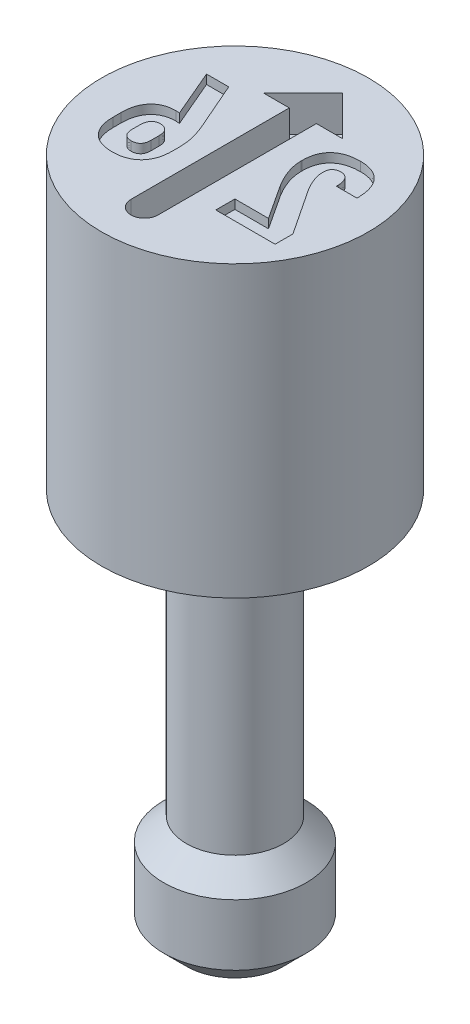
ISO-10303-21;
HEADER;
FILE_DESCRIPTION(('STEP AP214'),'2;1');
FILE_NAME('part.step','',(''),(''),'','','');
FILE_SCHEMA(('AUTOMOTIVE_DESIGN { 1 0 10303 214 1 1 1 1 }'));
ENDSEC;
DATA;
#1=APPLICATION_CONTEXT('core data for automotive mechanical design processes');
#2=APPLICATION_PROTOCOL_DEFINITION('international standard','automotive_design',2000,#1);
#3=PRODUCT_CONTEXT('',#1,'mechanical');
#4=PRODUCT('Part','Part','',(#3));
#5=PRODUCT_RELATED_PRODUCT_CATEGORY('part','',(#4));
#6=PRODUCT_DEFINITION_FORMATION('','',#4);
#7=PRODUCT_DEFINITION_CONTEXT('part definition',#1,'design');
#8=PRODUCT_DEFINITION('design','',#6,#7);
#9=PRODUCT_DEFINITION_SHAPE('','',#8);
#10=(LENGTH_UNIT() NAMED_UNIT(*) SI_UNIT(.MILLI.,.METRE.));
#11=(NAMED_UNIT(*) PLANE_ANGLE_UNIT() SI_UNIT($,.RADIAN.));
#12=(NAMED_UNIT(*) SI_UNIT($,.STERADIAN.) SOLID_ANGLE_UNIT());
#13=UNCERTAINTY_MEASURE_WITH_UNIT(LENGTH_MEASURE(1.E-05),#10,'distance_accuracy_value','');
#14=(GEOMETRIC_REPRESENTATION_CONTEXT(3) GLOBAL_UNCERTAINTY_ASSIGNED_CONTEXT((#13)) GLOBAL_UNIT_ASSIGNED_CONTEXT((#10,
#11,#12)) REPRESENTATION_CONTEXT('',''));
#15=CARTESIAN_POINT('',(0.,0.,0.));
#16=DIRECTION('',(0.,0.,1.));
#17=DIRECTION('',(1.,0.,0.));
#18=AXIS2_PLACEMENT_3D('',#15,#16,#17);
#19=CARTESIAN_POINT('',(0.,7.62,0.));
#20=DIRECTION('',(0.,1.,0.));
#21=DIRECTION('',(0.,0.,1.));
#22=AXIS2_PLACEMENT_3D('',#19,#20,#21);
#23=PLANE('',#22);
#24=DIRECTION('',(1.,0.,0.));
#25=VECTOR('',#24,1.);
#26=CARTESIAN_POINT('',(0.42767656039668,7.62,0.643446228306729));
#27=LINE('',#26,#25);
#28=CARTESIAN_POINT('',(0.42767656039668,7.62,0.643446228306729));
#29=VERTEX_POINT('',#28);
#30=CARTESIAN_POINT('',(1.09385959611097,7.62,0.643446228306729));
#31=VERTEX_POINT('',#30);
#32=EDGE_CURVE('E52',#29,#31,#27,.T.);
#33=ORIENTED_EDGE('',*,*,#32,.F.);
#34=DIRECTION('',(0.,0.,1.));
#35=VECTOR('',#34,1.);
#36=CARTESIAN_POINT('',(0.42767656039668,7.62,0.429030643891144));
#37=LINE('',#36,#35);
#38=CARTESIAN_POINT('',(0.42767656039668,7.62,0.429030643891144));
#39=VERTEX_POINT('',#38);
#40=EDGE_CURVE('E315',#39,#29,#37,.T.);
#41=ORIENTED_EDGE('',*,*,#40,.F.);
#42=DIRECTION('',(-1.,0.,0.));
#43=VECTOR('',#42,1.);
#44=CARTESIAN_POINT('',(0.805223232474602,7.62,0.429030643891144));
#45=LINE('',#44,#43);
#46=CARTESIAN_POINT('',(0.805223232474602,7.62,0.429030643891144));
#47=VERTEX_POINT('',#46);
#48=EDGE_CURVE('E318',#47,#39,#45,.T.);
#49=ORIENTED_EDGE('',*,*,#48,.F.);
#50=DIRECTION('',(0.548079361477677,0.,0.836426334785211));
#51=VECTOR('',#50,1.);
#52=CARTESIAN_POINT('',(0.548543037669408,7.62,0.0373098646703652));
#53=LINE('',#52,#51);
#54=CARTESIAN_POINT('',(0.548543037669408,7.62,0.0373098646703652));
#55=VERTEX_POINT('',#54);
#56=EDGE_CURVE('E1393',#55,#47,#53,.T.);
#57=ORIENTED_EDGE('',*,*,#56,.F.);
#58=CARTESIAN_POINT('',(0.430253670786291,7.62,-0.312919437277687));
#59=CARTESIAN_POINT('',(0.430591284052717,7.62,-0.299584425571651));
#60=CARTESIAN_POINT('',(0.431278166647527,7.62,-0.272454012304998));
#61=CARTESIAN_POINT('',(0.437374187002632,7.62,-0.231087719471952));
#62=CARTESIAN_POINT('',(0.446839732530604,7.62,-0.188424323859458));
#63=CARTESIAN_POINT('',(0.460417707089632,7.62,-0.14456094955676));
#64=CARTESIAN_POINT('',(0.477496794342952,7.62,-0.0998966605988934));
#65=CARTESIAN_POINT('',(0.497658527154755,7.62,-0.0543238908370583));
#66=CARTESIAN_POINT('',(0.521280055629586,7.62,-0.00825921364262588));
#67=CARTESIAN_POINT('',(0.539350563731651,7.62,0.021944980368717));
#68=CARTESIAN_POINT('',(0.548543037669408,7.62,0.0373098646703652));
#69=B_SPLINE_CURVE_WITH_KNOTS('',3,(#58,#59,#60,#61,#62,#63,#64,#65,#66,#67,#68),.UNSPECIFIED.,
.F.,.F.,(4,1,1,1,1,1,1,1,4),(0.,0.106874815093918,0.217439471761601,0.334588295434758,
0.457042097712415,0.585227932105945,0.717831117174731,0.856460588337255,1.),.UNSPECIFIED.);
#70=CARTESIAN_POINT('',(0.430253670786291,7.62,-0.312919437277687));
#71=VERTEX_POINT('',#70);
#72=EDGE_CURVE('E1388',#71,#55,#69,.T.);
#73=ORIENTED_EDGE('',*,*,#72,.F.);
#74=DIRECTION('',(0.,0.,1.));
#75=VECTOR('',#74,1.);
#76=CARTESIAN_POINT('',(0.430253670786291,7.62,-0.321939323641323));
#77=LINE('',#76,#75);
#78=CARTESIAN_POINT('',(0.430253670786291,7.62,-0.321939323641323));
#79=VERTEX_POINT('',#78);
#80=EDGE_CURVE('E1382',#79,#71,#77,.T.);
#81=ORIENTED_EDGE('',*,*,#80,.F.);
#82=CARTESIAN_POINT('',(0.766051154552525,7.62,-0.643047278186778));
#83=CARTESIAN_POINT('',(0.752727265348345,7.62,-0.642812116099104));
#84=CARTESIAN_POINT('',(0.726879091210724,7.62,-0.642355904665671));
#85=CARTESIAN_POINT('',(0.68938007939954,7.62,-0.638495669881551));
#86=CARTESIAN_POINT('',(0.654362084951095,7.61999999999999,-0.631928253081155));
#87=CARTESIAN_POINT('',(0.621577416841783,7.62,-0.623536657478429));
#88=CARTESIAN_POINT('',(0.591515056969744,7.62,-0.61163397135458));
#89=CARTESIAN_POINT('',(0.563617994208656,7.62,-0.597929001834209));
#90=CARTESIAN_POINT('',(0.538586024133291,7.62,-0.580893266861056));
#91=CARTESIAN_POINT('',(0.515640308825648,7.62,-0.561854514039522));
#92=CARTESIAN_POINT('',(0.495517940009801,7.62,-0.540011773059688));
#93=CARTESIAN_POINT('',(0.477823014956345,7.62,-0.515969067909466));
#94=CARTESIAN_POINT('',(0.463149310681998,7.62,-0.489392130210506));
#95=CARTESIAN_POINT('',(0.450880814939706,7.62,-0.460598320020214));
#96=CARTESIAN_POINT('',(0.441757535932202,7.62,-0.429243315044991));
#97=CARTESIAN_POINT('',(0.435122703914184,7.62,-0.395612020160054));
#98=CARTESIAN_POINT('',(0.430857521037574,7.62,-0.359588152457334));
#99=CARTESIAN_POINT('',(0.430459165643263,7.62,-0.334751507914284));
#100=CARTESIAN_POINT('',(0.430253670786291,7.62,-0.321939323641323));
#101=B_SPLINE_CURVE_WITH_KNOTS('',3,(#82,#83,#84,#85,#86,#87,#88,#89,#90,#91,#92,#93,#94,#95,
#96,#97,#98,#99,#100),.UNSPECIFIED.,.F.,.F.,(4,1,1,1,1,1,1,1,1,1,1,1,1,1,1,1,4),(0.,
0.0752568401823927,0.145997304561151,0.212623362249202,0.276423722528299,0.336803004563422,
0.394965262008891,0.451628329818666,0.50742447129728,0.563051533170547,0.618959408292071,
0.675661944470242,0.734157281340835,0.79541935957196,0.859754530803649,0.927653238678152,1.),.UNSPECIFIED.);
#102=CARTESIAN_POINT('',(0.766051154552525,7.62,-0.643047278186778));
#103=VERTEX_POINT('',#102);
#104=EDGE_CURVE('E1374',#103,#79,#101,.T.);
#105=ORIENTED_EDGE('',*,*,#104,.F.);
#106=CARTESIAN_POINT('',(1.10519888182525,7.62,-0.288436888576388));
#107=CARTESIAN_POINT('',(1.10445686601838,7.62,-0.302456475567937));
#108=CARTESIAN_POINT('',(1.10301342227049,7.62,-0.329728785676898));
#109=CARTESIAN_POINT('',(1.09754101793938,7.62,-0.369271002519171));
#110=CARTESIAN_POINT('',(1.08960037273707,7.62,-0.40634065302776));
#111=CARTESIAN_POINT('',(1.07912374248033,7.62,-0.440756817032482));
#112=CARTESIAN_POINT('',(1.06621557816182,7.62,-0.472707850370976));
#113=CARTESIAN_POINT('',(1.05039137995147,7.62,-0.501791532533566));
#114=CARTESIAN_POINT('',(1.03237279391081,7.62,-0.528713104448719));
#115=CARTESIAN_POINT('',(1.01130422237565,7.62,-0.552640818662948));
#116=CARTESIAN_POINT('',(0.988205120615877,7.62,-0.574172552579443));
#117=CARTESIAN_POINT('',(0.962595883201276,7.62,-0.59248062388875));
#118=CARTESIAN_POINT('',(0.935223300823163,7.62,-0.608494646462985));
#119=CARTESIAN_POINT('',(0.905296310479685,7.62,-0.620898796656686));
#120=CARTESIAN_POINT('',(0.873550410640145,7.62,-0.631176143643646));
#121=CARTESIAN_POINT('',(0.839541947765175,7.62,-0.637835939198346));
#122=CARTESIAN_POINT('',(0.80355010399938,7.62,-0.642522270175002));
#123=CARTESIAN_POINT('',(0.778781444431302,7.62,-0.642869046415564));
#124=CARTESIAN_POINT('',(0.766051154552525,7.62,-0.643047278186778));
#125=B_SPLINE_CURVE_WITH_KNOTS('',3,(#106,#107,#108,#109,#110,#111,#112,#113,#114,#115,#116,
#117,#118,#119,#120,#121,#122,#123,#124),.UNSPECIFIED.,.F.,.F.,(4,1,1,1,1,1,1,1,1,1,1,1,1,1,1,1,
4),(0.,0.0758438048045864,0.147538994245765,0.215467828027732,0.280523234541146,0.3417329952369,
0.401348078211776,0.45916270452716,0.516417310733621,0.573254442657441,0.629435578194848,
0.686212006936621,0.744244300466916,0.804147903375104,0.866242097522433,0.931252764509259,1.),.UNSPECIFIED.);
#126=CARTESIAN_POINT('',(1.10519888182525,7.62,-0.288436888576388));
#127=VERTEX_POINT('',#126);
#128=EDGE_CURVE('E1369',#127,#103,#125,.T.);
#129=ORIENTED_EDGE('',*,*,#128,.F.);
#130=DIRECTION('',(0.,0.,-1.));
#131=VECTOR('',#130,1.);
#132=CARTESIAN_POINT('',(1.10519888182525,7.62,-0.264727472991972));
#133=LINE('',#132,#131);
#134=CARTESIAN_POINT('',(1.10519888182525,7.62,-0.264727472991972));
#135=VERTEX_POINT('',#134);
#136=EDGE_CURVE('E1366',#135,#127,#133,.T.);
#137=ORIENTED_EDGE('',*,*,#136,.F.);
#138=DIRECTION('',(1.,0.,0.));
#139=VECTOR('',#138,1.);
#140=CARTESIAN_POINT('',(0.873774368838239,7.62,-0.264727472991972));
#141=LINE('',#140,#139);
#142=CARTESIAN_POINT('',(0.873774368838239,7.62,-0.264727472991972));
#143=VERTEX_POINT('',#142);
#144=EDGE_CURVE('E1363',#143,#135,#141,.T.);
#145=ORIENTED_EDGE('',*,*,#144,.F.);
#146=DIRECTION('',(0.,0.,1.));
#147=VECTOR('',#146,1.);
#148=CARTESIAN_POINT('',(0.873774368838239,7.62,-0.289467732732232));
#149=LINE('',#148,#147);
#150=CARTESIAN_POINT('',(0.873774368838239,7.62,-0.289467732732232));
#151=VERTEX_POINT('',#150);
#152=EDGE_CURVE('E1357',#151,#143,#149,.T.);
#153=ORIENTED_EDGE('',*,*,#152,.F.);
#154=CARTESIAN_POINT('',(0.76244320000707,7.62,-0.428631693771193));
#155=CARTESIAN_POINT('',(0.77049754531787,7.62,-0.428345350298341));
#156=CARTESIAN_POINT('',(0.785892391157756,7.62,-0.427798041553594));
#157=CARTESIAN_POINT('',(0.80742956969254,7.62,-0.420548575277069));
#158=CARTESIAN_POINT('',(0.826583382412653,7.62,-0.409811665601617));
#159=CARTESIAN_POINT('',(0.842197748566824,7.62,-0.393653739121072));
#160=CARTESIAN_POINT('',(0.855078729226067,7.62,-0.373641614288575));
#161=CARTESIAN_POINT('',(0.86432501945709,7.62,-0.349206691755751));
#162=CARTESIAN_POINT('',(0.871141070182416,7.62,-0.320807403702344));
#163=CARTESIAN_POINT('',(0.872861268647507,7.62,-0.300334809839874));
#164=CARTESIAN_POINT('',(0.873774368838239,7.62,-0.289467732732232));
#165=B_SPLINE_CURVE_WITH_KNOTS('',3,(#154,#155,#156,#157,#158,#159,#160,#161,#162,#163,#164),
.UNSPECIFIED.,.F.,.F.,(4,1,1,1,1,1,1,1,4),(0.,0.120292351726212,0.229923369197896,
0.337343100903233,0.446693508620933,0.563227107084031,0.692213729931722,0.836623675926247,1.),.UNSPECIFIED.);
#166=CARTESIAN_POINT('',(0.76244320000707,7.62,-0.428631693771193));
#167=VERTEX_POINT('',#166);
#168=EDGE_CURVE('E1349',#167,#151,#165,.T.);
#169=ORIENTED_EDGE('',*,*,#168,.F.);
#170=CARTESIAN_POINT('',(0.662451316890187,7.62,-0.327866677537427));
#171=CARTESIAN_POINT('',(0.662715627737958,7.62,-0.335707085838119));
#172=CARTESIAN_POINT('',(0.663214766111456,7.62,-0.350513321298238));
#173=CARTESIAN_POINT('',(0.667766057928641,7.61999999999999,-0.371312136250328));
#174=CARTESIAN_POINT('',(0.675827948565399,7.62,-0.389014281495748));
#175=CARTESIAN_POINT('',(0.687164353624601,7.62,-0.403661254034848));
#176=CARTESIAN_POINT('',(0.701756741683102,7.62,-0.414940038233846));
#177=CARTESIAN_POINT('',(0.719347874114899,7.62,-0.423051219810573));
#178=CARTESIAN_POINT('',(0.739934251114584,7.62,-0.427929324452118));
#179=CARTESIAN_POINT('',(0.754683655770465,7.62,-0.428389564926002));
#180=CARTESIAN_POINT('',(0.76244320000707,7.62,-0.428631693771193));
#181=B_SPLINE_CURVE_WITH_KNOTS('',3,(#170,#171,#172,#173,#174,#175,#176,#177,#178,#179,#180),
.UNSPECIFIED.,.F.,.F.,(4,1,1,1,1,1,1,1,4),(0.,0.144747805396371,0.273349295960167,
0.39052211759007,0.501330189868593,0.612138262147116,0.727872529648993,0.856835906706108,1.),.UNSPECIFIED.);
#182=CARTESIAN_POINT('',(0.662451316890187,7.62,-0.327866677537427));
#183=VERTEX_POINT('',#182);
#184=EDGE_CURVE('E1344',#183,#167,#181,.T.);
#185=ORIENTED_EDGE('',*,*,#184,.F.);
#186=DIRECTION('',(0.,0.,-1.));
#187=VECTOR('',#186,1.);
#188=CARTESIAN_POINT('',(0.662451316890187,7.62,-0.318073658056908));
#189=LINE('',#188,#187);
#190=CARTESIAN_POINT('',(0.662451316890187,7.62,-0.318073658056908));
#191=VERTEX_POINT('',#190);
#192=EDGE_CURVE('E1338',#191,#183,#189,.T.);
#193=ORIENTED_EDGE('',*,*,#192,.F.);
#194=CARTESIAN_POINT('',(0.749557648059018,7.62,-0.076340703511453));
#195=CARTESIAN_POINT('',(0.742659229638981,7.62,-0.0879605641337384));
#196=CARTESIAN_POINT('',(0.729227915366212,7.62,-0.110584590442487));
#197=CARTESIAN_POINT('',(0.711563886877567,7.62,-0.144498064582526));
#198=CARTESIAN_POINT('',(0.696358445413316,7.62,-0.177087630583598));
#199=CARTESIAN_POINT('',(0.684334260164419,7.62,-0.20849394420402));
#200=CARTESIAN_POINT('',(0.67473087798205,7.62,-0.238343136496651));
#201=CARTESIAN_POINT('',(0.667660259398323,7.62,-0.266456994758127));
#202=CARTESIAN_POINT('',(0.663232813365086,7.62,-0.292848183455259));
#203=CARTESIAN_POINT('',(0.662704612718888,7.62,-0.309897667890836));
#204=CARTESIAN_POINT('',(0.662451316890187,7.62,-0.318073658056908));
#205=B_SPLINE_CURVE_WITH_KNOTS('',3,(#194,#195,#196,#197,#198,#199,#200,#201,#202,#203,#204),
.UNSPECIFIED.,.F.,.F.,(4,1,1,1,1,1,1,1,4),(0.,0.156015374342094,0.303764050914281,
0.44135707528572,0.571046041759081,0.691824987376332,0.80321632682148,0.905633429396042,1.),.UNSPECIFIED.);
#206=CARTESIAN_POINT('',(0.749557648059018,7.62,-0.076340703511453));
#207=VERTEX_POINT('',#206);
#208=EDGE_CURVE('E1333',#207,#191,#205,.T.);
#209=ORIENTED_EDGE('',*,*,#208,.F.);
#210=DIRECTION('',(-0.552217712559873,0.,-0.833699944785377));
#211=VECTOR('',#210,1.);
#212=CARTESIAN_POINT('',(1.09385959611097,7.62,0.443462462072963));
#213=LINE('',#212,#211);
#214=CARTESIAN_POINT('',(1.09385959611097,7.62,0.443462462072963));
#215=VERTEX_POINT('',#214);
#216=EDGE_CURVE('E1330',#215,#207,#213,.T.);
#217=ORIENTED_EDGE('',*,*,#216,.F.);
#218=DIRECTION('',(0.,0.,-1.));
#219=VECTOR('',#218,1.);
#220=CARTESIAN_POINT('',(1.09385959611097,7.62,0.643446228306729));
#221=LINE('',#220,#219);
#222=EDGE_CURVE('E1328',#31,#215,#221,.T.);
#223=ORIENTED_EDGE('',*,*,#222,.F.);
#224=EDGE_LOOP('',(#33,#41,#49,#57,#73,#81,#105,#129,#137,#145,#153,#169,#185,#193,#209,#217,#223));
#225=FACE_BOUND('',#224,.T.);
#226=CARTESIAN_POINT('',(-1.05194559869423,7.62,0.319503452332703));
#227=CARTESIAN_POINT('',(-1.05172464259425,7.62,0.332570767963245));
#228=CARTESIAN_POINT('',(-1.05129318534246,7.62,0.358087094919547));
#229=CARTESIAN_POINT('',(-1.04716996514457,7.62,0.395266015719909));
#230=CARTESIAN_POINT('',(-1.04008485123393,7.62,0.430104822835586));
#231=CARTESIAN_POINT('',(-1.03109793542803,7.62,0.462907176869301));
#232=CARTESIAN_POINT('',(-1.01845810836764,7.62,0.493166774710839));
#233=CARTESIAN_POINT('',(-1.00363282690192,7.62,0.52148516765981));
#234=CARTESIAN_POINT('',(-0.985677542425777,7.62,0.547325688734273));
#235=CARTESIAN_POINT('',(-0.965318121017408,7.62,0.570965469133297));
#236=CARTESIAN_POINT('',(-0.942219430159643,7.62,0.59175298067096));
#237=CARTESIAN_POINT('',(-0.917218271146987,7.62,0.610350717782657));
#238=CARTESIAN_POINT('',(-0.889577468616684,7.62,0.625426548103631));
#239=CARTESIAN_POINT('',(-0.860048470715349,7.62,0.638226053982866));
#240=CARTESIAN_POINT('',(-0.828142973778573,7.62,0.64799705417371));
#241=CARTESIAN_POINT('',(-0.793945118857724,7.62,0.654778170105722));
#242=CARTESIAN_POINT('',(-0.757592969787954,7.62,0.65939229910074));
#243=CARTESIAN_POINT('',(-0.732570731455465,7.62,0.65975432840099));
#244=CARTESIAN_POINT('',(-0.71975606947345,7.62,0.659939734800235));
#245=B_SPLINE_CURVE_WITH_KNOTS('',3,(#226,#227,#228,#229,#230,#231,#232,#233,#234,#235,#236,
#237,#238,#239,#240,#241,#242,#243,#244),.UNSPECIFIED.,.F.,.F.,(4,1,1,1,1,1,1,1,1,1,1,1,1,1,1,1,
4),(0.,0.0724842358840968,0.141538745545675,0.207155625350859,0.269611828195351,
0.329885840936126,0.388733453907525,0.446639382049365,0.504074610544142,0.561430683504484,
0.618723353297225,0.676542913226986,0.73568316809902,0.797040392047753,0.86125581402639,
0.928944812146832,1.),.UNSPECIFIED.);
#246=CARTESIAN_POINT('',(-1.05194559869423,7.62,0.319503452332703));
#247=VERTEX_POINT('',#246);
#248=CARTESIAN_POINT('',(-0.71975606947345,7.62,0.659939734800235));
#249=VERTEX_POINT('',#248);
#250=EDGE_CURVE('E60',#247,#249,#245,.T.);
#251=ORIENTED_EDGE('',*,*,#250,.F.);
#252=DIRECTION('',(0.,0.,1.));
#253=VECTOR('',#252,1.);
#254=CARTESIAN_POINT('',(-1.05194559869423,7.62,0.22698518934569));
#255=LINE('',#254,#253);
#256=CARTESIAN_POINT('',(-1.05194559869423,7.62,0.22698518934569));
#257=VERTEX_POINT('',#256);
#258=EDGE_CURVE('E436',#257,#247,#255,.T.);
#259=ORIENTED_EDGE('',*,*,#258,.F.);
#260=CARTESIAN_POINT('',(-0.762278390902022,7.62,-0.0987615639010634));
#261=CARTESIAN_POINT('',(-0.773375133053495,7.62,-0.0985569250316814));
#262=CARTESIAN_POINT('',(-0.794963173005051,7.62,-0.098158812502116));
#263=CARTESIAN_POINT('',(-0.826432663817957,7.62,-0.0938218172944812));
#264=CARTESIAN_POINT('',(-0.856063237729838,7.61999999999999,-0.0872687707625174));
#265=CARTESIAN_POINT('',(-0.883816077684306,7.62,-0.077982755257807));
#266=CARTESIAN_POINT('',(-0.909680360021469,7.61999999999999,-0.0659990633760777));
#267=CARTESIAN_POINT('',(-0.933651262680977,7.62,-0.0513197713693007));
#268=CARTESIAN_POINT('',(-0.955821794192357,7.62,-0.0338701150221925));
#269=CARTESIAN_POINT('',(-0.975843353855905,7.62,-0.0136947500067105));
#270=CARTESIAN_POINT('',(-0.993945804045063,7.62,0.00867483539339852));
#271=CARTESIAN_POINT('',(-1.00952074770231,7.62,0.0334497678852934));
#272=CARTESIAN_POINT('',(-1.02260703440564,7.62,0.0603598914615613));
#273=CARTESIAN_POINT('',(-1.03355799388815,7.62,0.089393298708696));
#274=CARTESIAN_POINT('',(-1.04168301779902,7.62,0.120779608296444));
#275=CARTESIAN_POINT('',(-1.04753301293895,7.62,0.154305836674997));
#276=CARTESIAN_POINT('',(-1.0511990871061,7.62,0.189966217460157));
#277=CARTESIAN_POINT('',(-1.0516925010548,7.62,0.214434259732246));
#278=CARTESIAN_POINT('',(-1.05194559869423,7.62,0.22698518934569));
#279=B_SPLINE_CURVE_WITH_KNOTS('',3,(#260,#261,#262,#263,#264,#265,#266,#267,#268,#269,#270,
#271,#272,#273,#274,#275,#276,#277,#278),.UNSPECIFIED.,.F.,.F.,(4,1,1,1,1,1,1,1,1,1,1,1,1,1,1,1,
4),(0.,0.0672318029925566,0.130795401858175,0.192197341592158,0.250990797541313,
0.307842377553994,0.364648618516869,0.421013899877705,0.478461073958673,0.536614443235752,
0.59513046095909,0.655453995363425,0.717748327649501,0.782929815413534,0.851683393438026,
0.923920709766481,1.),.UNSPECIFIED.);
#280=CARTESIAN_POINT('',(-0.762278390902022,7.62,-0.0987615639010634));
#281=VERTEX_POINT('',#280);
#282=EDGE_CURVE('E615',#281,#257,#279,.T.);
#283=ORIENTED_EDGE('',*,*,#282,.F.);
#284=CARTESIAN_POINT('',(-0.607394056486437,7.62,-0.0144900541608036));
#285=CARTESIAN_POINT('',(-0.611940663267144,7.62,-0.0212432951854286));
#286=CARTESIAN_POINT('',(-0.620805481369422,7.62,-0.0344105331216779));
#287=CARTESIAN_POINT('',(-0.636813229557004,7.62,-0.0514318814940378));
#288=CARTESIAN_POINT('',(-0.653932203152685,7.62,-0.066222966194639));
#289=CARTESIAN_POINT('',(-0.672867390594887,7.62,-0.0780226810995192));
#290=CARTESIAN_POINT('',(-0.693124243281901,7.62,-0.087380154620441));
#291=CARTESIAN_POINT('',(-0.714827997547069,7.62,-0.0942271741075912));
#292=CARTESIAN_POINT('',(-0.738090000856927,7.62,-0.0980337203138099));
#293=CARTESIAN_POINT('',(-0.754104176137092,7.62,-0.0985155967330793));
#294=CARTESIAN_POINT('',(-0.762278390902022,7.62,-0.0987615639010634));
#295=B_SPLINE_CURVE_WITH_KNOTS('',3,(#284,#285,#286,#287,#288,#289,#290,#291,#292,#293,#294),
.UNSPECIFIED.,.F.,.F.,(4,1,1,1,1,1,1,1,4),(0.,0.132048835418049,0.257464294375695,
0.378252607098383,0.498661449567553,0.618543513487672,0.739918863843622,0.867245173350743,1.),.UNSPECIFIED.);
#296=CARTESIAN_POINT('',(-0.719187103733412,7.62,-0.094637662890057));
#297=VERTEX_POINT('',#296);
#298=EDGE_CURVE('E620',#297,#281,#295,.T.);
#299=ORIENTED_EDGE('',*,*,#298,.F.);
#300=DIRECTION('',(0.39302915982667,0.,0.919526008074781));
#301=VECTOR('',#300,1.);
#302=CARTESIAN_POINT('',(-0.946541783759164,7.62,-0.626553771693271));
#303=LINE('',#302,#301);
#304=CARTESIAN_POINT('',(-0.946541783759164,7.62,-0.626553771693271));
#305=VERTEX_POINT('',#304);
#306=EDGE_CURVE('E628',#305,#297,#303,.T.);
#307=ORIENTED_EDGE('',*,*,#306,.F.);
#308=DIRECTION('',(-1.,0.,0.));
#309=VECTOR('',#308,1.);
#310=CARTESIAN_POINT('',(-0.697077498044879,7.62,-0.626553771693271));
#311=LINE('',#310,#309);
#312=CARTESIAN_POINT('',(-0.697077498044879,7.62,-0.626553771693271));
#313=VERTEX_POINT('',#312);
#314=EDGE_CURVE('E634',#313,#305,#311,.T.);
#315=ORIENTED_EDGE('',*,*,#314,.F.);
#316=DIRECTION('',(-0.399254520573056,0.,-0.916840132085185));
#317=VECTOR('',#316,1.);
#318=CARTESIAN_POINT('',(-0.46926093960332,7.62,-0.103400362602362));
#319=LINE('',#318,#317);
#320=CARTESIAN_POINT('',(-0.46926093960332,7.62,-0.103400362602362));
#321=VERTEX_POINT('',#320);
#322=EDGE_CURVE('E637',#321,#313,#319,.T.);
#323=ORIENTED_EDGE('',*,*,#322,.F.);
#324=CARTESIAN_POINT('',(-0.389112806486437,7.62,0.233943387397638));
#325=CARTESIAN_POINT('',(-0.389326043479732,7.62,0.218813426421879));
#326=CARTESIAN_POINT('',(-0.389746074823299,7.62,0.189010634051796));
#327=CARTESIAN_POINT('',(-0.394090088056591,7.62,0.14512700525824));
#328=CARTESIAN_POINT('',(-0.400606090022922,7.62,0.102633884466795));
#329=CARTESIAN_POINT('',(-0.413827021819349,7.62,0.0473365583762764));
#330=CARTESIAN_POINT('',(-0.435510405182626,7.62,-0.0218572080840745));
#331=CARTESIAN_POINT('',(-0.457842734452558,7.62,-0.0758133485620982));
#332=CARTESIAN_POINT('',(-0.46926093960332,7.62,-0.103400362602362));
#333=B_SPLINE_CURVE_WITH_KNOTS('',3,(#324,#325,#326,#327,#328,#329,#330,#331,#332),
.UNSPECIFIED.,.F.,.F.,(4,1,1,1,1,1,4),(0.,0.129878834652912,0.255833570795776,0.378319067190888,
0.498739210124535,0.743712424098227,1.),.UNSPECIFIED.);
#334=CARTESIAN_POINT('',(-0.389112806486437,7.62,0.233943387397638));
#335=VERTEX_POINT('',#334);
#336=EDGE_CURVE('E640',#335,#321,#333,.T.);
#337=ORIENTED_EDGE('',*,*,#336,.F.);
#338=DIRECTION('',(0.,0.,-1.));
#339=VECTOR('',#338,1.);
#340=CARTESIAN_POINT('',(-0.389112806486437,7.62,0.317184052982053));
#341=LINE('',#340,#339);
#342=CARTESIAN_POINT('',(-0.389112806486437,7.62,0.317184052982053));
#343=VERTEX_POINT('',#342);
#344=EDGE_CURVE('E645',#343,#335,#341,.T.);
#345=ORIENTED_EDGE('',*,*,#344,.F.);
#346=CARTESIAN_POINT('',(-0.71975606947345,7.62,0.659939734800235));
#347=CARTESIAN_POINT('',(-0.70702670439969,7.62,0.659756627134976));
#348=CARTESIAN_POINT('',(-0.682174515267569,7.62,0.659399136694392));
#349=CARTESIAN_POINT('',(-0.646002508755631,7.62,0.654744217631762));
#350=CARTESIAN_POINT('',(-0.611955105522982,7.62,0.648046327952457));
#351=CARTESIAN_POINT('',(-0.580169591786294,7.62,0.638168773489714));
#352=CARTESIAN_POINT('',(-0.550702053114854,7.62,0.625436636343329));
#353=CARTESIAN_POINT('',(-0.52308171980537,7.62,0.610334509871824));
#354=CARTESIAN_POINT('',(-0.498064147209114,7.62,0.591845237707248));
#355=CARTESIAN_POINT('',(-0.475255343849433,7.61999999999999,0.570851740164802));
#356=CARTESIAN_POINT('',(-0.45472435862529,7.62,0.547396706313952));
#357=CARTESIAN_POINT('',(-0.437325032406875,7.62,0.521156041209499));
#358=CARTESIAN_POINT('',(-0.422163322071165,7.62,0.492937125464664));
#359=CARTESIAN_POINT('',(-0.410097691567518,7.62,0.46219026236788));
#360=CARTESIAN_POINT('',(-0.40056521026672,7.62,0.429239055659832));
#361=CARTESIAN_POINT('',(-0.393986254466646,7.62,0.393848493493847));
#362=CARTESIAN_POINT('',(-0.389736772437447,7.62,0.356288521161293));
#363=CARTESIAN_POINT('',(-0.38932408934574,7.62,0.330425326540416));
#364=CARTESIAN_POINT('',(-0.389112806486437,7.62,0.317184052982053));
#365=B_SPLINE_CURVE_WITH_KNOTS('',3,(#346,#347,#348,#349,#350,#351,#352,#353,#354,#355,#356,
#357,#358,#359,#360,#361,#362,#363,#364),.UNSPECIFIED.,.F.,.F.,(4,1,1,1,1,1,1,1,1,1,1,1,1,1,1,1,
4),(0.,0.0704410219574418,0.137525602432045,0.201615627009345,0.262398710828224,
0.321423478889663,0.379130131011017,0.436310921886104,0.493204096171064,0.550527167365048,
0.608445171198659,0.667177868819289,0.72759690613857,0.790976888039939,0.856841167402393,
0.926706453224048,1.),.UNSPECIFIED.);
#366=EDGE_CURVE('E651',#249,#343,#365,.T.);
#367=ORIENTED_EDGE('',*,*,#366,.F.);
#368=EDGE_LOOP('',(#251,#259,#283,#299,#307,#315,#323,#337,#345,#367));
#369=FACE_BOUND('',#368,.T.);
#370=CARTESIAN_POINT('',(0.,7.62,1.016));
#371=DIRECTION('',(0.,1.,0.));
#372=DIRECTION('',(0.,0.,1.));
#373=AXIS2_PLACEMENT_3D('',#370,#371,#372);
#374=CIRCLE('',#373,0.1524);
#375=CARTESIAN_POINT('',(-0.1524,7.62,1.016));
#376=VERTEX_POINT('',#375);
#377=CARTESIAN_POINT('',(0.1524,7.62,1.016));
#378=VERTEX_POINT('',#377);
#379=EDGE_CURVE('E570',#376,#378,#374,.T.);
#380=ORIENTED_EDGE('',*,*,#379,.F.);
#381=DIRECTION('',(0.,0.,1.));
#382=VECTOR('',#381,1.);
#383=CARTESIAN_POINT('',(-0.1524,7.62,1.016));
#384=LINE('',#383,#382);
#385=CARTESIAN_POINT('',(-0.1524,7.62,-0.762));
#386=VERTEX_POINT('',#385);
#387=EDGE_CURVE('E551',#386,#376,#384,.T.);
#388=ORIENTED_EDGE('',*,*,#387,.F.);
#389=DIRECTION('',(1.,0.,0.));
#390=VECTOR('',#389,1.);
#391=CARTESIAN_POINT('',(-0.1524,7.62,-0.762));
#392=LINE('',#391,#390);
#393=CARTESIAN_POINT('',(-0.4445,7.62,-0.762));
#394=VERTEX_POINT('',#393);
#395=EDGE_CURVE('E555',#394,#386,#392,.T.);
#396=ORIENTED_EDGE('',*,*,#395,.F.);
#397=DIRECTION('',(-0.707106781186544,0.,0.707106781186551));
#398=VECTOR('',#397,1.);
#399=CARTESIAN_POINT('',(0.,7.62,-1.2065));
#400=LINE('',#399,#398);
#401=CARTESIAN_POINT('',(0.,7.62,-1.2065));
#402=VERTEX_POINT('',#401);
#403=EDGE_CURVE('E558',#402,#394,#400,.T.);
#404=ORIENTED_EDGE('',*,*,#403,.F.);
#405=DIRECTION('',(-0.707106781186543,0.,-0.707106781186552));
#406=VECTOR('',#405,1.);
#407=CARTESIAN_POINT('',(0.4445,7.62,-0.761999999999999));
#408=LINE('',#407,#406);
#409=CARTESIAN_POINT('',(0.4445,7.62,-0.761999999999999));
#410=VERTEX_POINT('',#409);
#411=EDGE_CURVE('E561',#410,#402,#408,.T.);
#412=ORIENTED_EDGE('',*,*,#411,.F.);
#413=DIRECTION('',(1.,0.,0.));
#414=VECTOR('',#413,1.);
#415=CARTESIAN_POINT('',(0.1524,7.62,-0.762));
#416=LINE('',#415,#414);
#417=CARTESIAN_POINT('',(0.1524,7.62,-0.762));
#418=VERTEX_POINT('',#417);
#419=EDGE_CURVE('E564',#418,#410,#416,.T.);
#420=ORIENTED_EDGE('',*,*,#419,.F.);
#421=DIRECTION('',(0.,0.,-1.));
#422=VECTOR('',#421,1.);
#423=CARTESIAN_POINT('',(0.1524,7.62,1.016));
#424=LINE('',#423,#422);
#425=EDGE_CURVE('E567',#378,#418,#424,.T.);
#426=ORIENTED_EDGE('',*,*,#425,.F.);
#427=EDGE_LOOP('',(#380,#388,#396,#404,#412,#420,#426));
#428=FACE_BOUND('',#427,.T.);
#429=CARTESIAN_POINT('',(0.,7.62,0.));
#430=DIRECTION('',(0.,-1.,0.));
#431=DIRECTION('',(0.,0.,-1.));
#432=AXIS2_PLACEMENT_3D('',#429,#430,#431);
#433=CIRCLE('',#432,1.4986);
#434=CARTESIAN_POINT('',(0.,7.62,-1.4986));
#435=VERTEX_POINT('',#434);
#436=EDGE_CURVE('E11',#435,#435,#433,.T.);
#437=ORIENTED_EDGE('',*,*,#436,.F.);
#438=EDGE_LOOP('',(#437));
#439=FACE_BOUND('',#438,.T.);
#440=ADVANCED_FACE('F37',(#225,#369,#428,#439),#23,.T.);
#441=CARTESIAN_POINT('',(0.,0.,0.));
#442=DIRECTION('',(0.,-1.,0.));
#443=DIRECTION('',(0.,0.,-1.));
#444=AXIS2_PLACEMENT_3D('',#441,#442,#443);
#445=CYLINDRICAL_SURFACE('',#444,1.4986);
#446=ORIENTED_EDGE('',*,*,#436,.T.);
#447=EDGE_LOOP('',(#446));
#448=FACE_BOUND('',#447,.T.);
#449=CARTESIAN_POINT('',(0.,4.3688,0.));
#450=DIRECTION('',(0.,-1.,0.));
#451=DIRECTION('',(0.,0.,-1.));
#452=AXIS2_PLACEMENT_3D('',#449,#450,#451);
#453=CIRCLE('',#452,1.4986);
#454=CARTESIAN_POINT('',(0.,4.3688,-1.4986));
#455=VERTEX_POINT('',#454);
#456=EDGE_CURVE('E45',#455,#455,#453,.T.);
#457=ORIENTED_EDGE('',*,*,#456,.F.);
#458=EDGE_LOOP('',(#457));
#459=FACE_BOUND('',#458,.T.);
#460=ADVANCED_FACE('F507',(#448,#459),#445,.T.);
#461=CARTESIAN_POINT('',(1.4986,4.3688,0.));
#462=DIRECTION('',(0.,-1.,0.));
#463=DIRECTION('',(0.,0.,-1.));
#464=AXIS2_PLACEMENT_3D('',#461,#462,#463);
#465=PLANE('',#464);
#466=ORIENTED_EDGE('',*,*,#456,.T.);
#467=EDGE_LOOP('',(#466));
#468=FACE_BOUND('',#467,.T.);
#469=CARTESIAN_POINT('',(0.,4.3688,0.));
#470=DIRECTION('',(0.,-1.,0.));
#471=DIRECTION('',(0.,0.,-1.));
#472=AXIS2_PLACEMENT_3D('',#469,#470,#471);
#473=CIRCLE('',#472,0.5461);
#474=CARTESIAN_POINT('',(0.,4.3688,-0.5461));
#475=VERTEX_POINT('',#474);
#476=EDGE_CURVE('E519',#475,#475,#473,.T.);
#477=ORIENTED_EDGE('',*,*,#476,.F.);
#478=EDGE_LOOP('',(#477));
#479=FACE_BOUND('',#478,.T.);
#480=ADVANCED_FACE('F504',(#468,#479),#465,.T.);
#481=CARTESIAN_POINT('',(0.,0.,0.));
#482=DIRECTION('',(0.,-1.,0.));
#483=DIRECTION('',(0.,0.,-1.));
#484=AXIS2_PLACEMENT_3D('',#481,#482,#483);
#485=CYLINDRICAL_SURFACE('',#484,0.5461);
#486=ORIENTED_EDGE('',*,*,#476,.T.);
#487=EDGE_LOOP('',(#486));
#488=FACE_BOUND('',#487,.T.);
#489=CARTESIAN_POINT('',(0.,1.1938,0.));
#490=DIRECTION('',(0.,-1.,0.));
#491=DIRECTION('',(0.,0.,-1.));
#492=AXIS2_PLACEMENT_3D('',#489,#490,#491);
#493=CIRCLE('',#492,0.5461);
#494=CARTESIAN_POINT('',(0.,1.1938,-0.5461));
#495=VERTEX_POINT('',#494);
#496=EDGE_CURVE('E521',#495,#495,#493,.T.);
#497=ORIENTED_EDGE('',*,*,#496,.F.);
#498=EDGE_LOOP('',(#497));
#499=FACE_BOUND('',#498,.T.);
#500=ADVANCED_FACE('F500',(#488,#499),#485,.T.);
#501=CARTESIAN_POINT('',(0.,0.939900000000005,0.));
#502=DIRECTION('',(0.,-1.,0.));
#503=DIRECTION('',(0.,0.,-1.));
#504=AXIS2_PLACEMENT_3D('',#501,#502,#503);
#505=CONICAL_SURFACE('',#504,0.8,0.785398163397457);
#506=ORIENTED_EDGE('',*,*,#496,.T.);
#507=EDGE_LOOP('',(#506));
#508=FACE_BOUND('',#507,.T.);
#509=CARTESIAN_POINT('',(0.,0.939900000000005,0.));
#510=DIRECTION('',(0.,-1.,0.));
#511=DIRECTION('',(0.,0.,-1.));
#512=AXIS2_PLACEMENT_3D('',#509,#510,#511);
#513=CIRCLE('',#512,0.8);
#514=CARTESIAN_POINT('',(0.,0.939900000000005,-0.8));
#515=VERTEX_POINT('',#514);
#516=EDGE_CURVE('E526',#515,#515,#513,.T.);
#517=ORIENTED_EDGE('',*,*,#516,.F.);
#518=EDGE_LOOP('',(#517));
#519=FACE_BOUND('',#518,.T.);
#520=ADVANCED_FACE('F496',(#508,#519),#505,.T.);
#521=CARTESIAN_POINT('',(0.,0.,0.));
#522=DIRECTION('',(0.,-1.,0.));
#523=DIRECTION('',(0.,0.,-1.));
#524=AXIS2_PLACEMENT_3D('',#521,#522,#523);
#525=CYLINDRICAL_SURFACE('',#524,0.8);
#526=ORIENTED_EDGE('',*,*,#516,.T.);
#527=EDGE_LOOP('',(#526));
#528=FACE_BOUND('',#527,.T.);
#529=CARTESIAN_POINT('',(0.,0.254,0.));
#530=DIRECTION('',(0.,-1.,0.));
#531=DIRECTION('',(0.,0.,-1.));
#532=AXIS2_PLACEMENT_3D('',#529,#530,#531);
#533=CIRCLE('',#532,0.8);
#534=CARTESIAN_POINT('',(0.,0.254,-0.8));
#535=VERTEX_POINT('',#534);
#536=EDGE_CURVE('E529',#535,#535,#533,.T.);
#537=ORIENTED_EDGE('',*,*,#536,.F.);
#538=EDGE_LOOP('',(#537));
#539=FACE_BOUND('',#538,.T.);
#540=ADVANCED_FACE('F492',(#528,#539),#525,.T.);
#541=CARTESIAN_POINT('',(0.,0.,0.));
#542=DIRECTION('',(0.,1.,0.));
#543=DIRECTION('',(0.,0.,1.));
#544=AXIS2_PLACEMENT_3D('',#541,#542,#543);
#545=CONICAL_SURFACE('',#544,0.546000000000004,0.78539816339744);
#546=ORIENTED_EDGE('',*,*,#536,.T.);
#547=EDGE_LOOP('',(#546));
#548=FACE_BOUND('',#547,.T.);
#549=CARTESIAN_POINT('',(0.,0.,0.));
#550=DIRECTION('',(0.,-1.,0.));
#551=DIRECTION('',(0.,0.,-1.));
#552=AXIS2_PLACEMENT_3D('',#549,#550,#551);
#553=CIRCLE('',#552,0.546000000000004);
#554=CARTESIAN_POINT('',(0.,0.,-0.546000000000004));
#555=VERTEX_POINT('',#554);
#556=EDGE_CURVE('E532',#555,#555,#553,.T.);
#557=ORIENTED_EDGE('',*,*,#556,.F.);
#558=EDGE_LOOP('',(#557));
#559=FACE_BOUND('',#558,.T.);
#560=ADVANCED_FACE('F488',(#548,#559),#545,.T.);
#561=CARTESIAN_POINT('',(0.546000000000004,0.,0.));
#562=DIRECTION('',(0.,-1.,0.));
#563=DIRECTION('',(0.,0.,-1.));
#564=AXIS2_PLACEMENT_3D('',#561,#562,#563);
#565=PLANE('',#564);
#566=ORIENTED_EDGE('',*,*,#556,.T.);
#567=EDGE_LOOP('',(#566));
#568=FACE_BOUND('',#567,.T.);
#569=ADVANCED_FACE('F484',(#568),#565,.T.);
#570=CARTESIAN_POINT('',(0.,7.2136,1.016));
#571=DIRECTION('',(0.,1.,0.));
#572=DIRECTION('',(0.,0.,1.));
#573=AXIS2_PLACEMENT_3D('',#570,#571,#572);
#574=CYLINDRICAL_SURFACE('',#573,0.1524);
#575=ORIENTED_EDGE('',*,*,#379,.T.);
#576=DIRECTION('',(0.,1.,0.));
#577=VECTOR('',#576,1.);
#578=CARTESIAN_POINT('',(0.1524,7.2136,1.016));
#579=LINE('',#578,#577);
#580=CARTESIAN_POINT('',(0.1524,7.2136,1.016));
#581=VERTEX_POINT('',#580);
#582=EDGE_CURVE('E536',#581,#378,#579,.T.);
#583=ORIENTED_EDGE('',*,*,#582,.F.);
#584=CARTESIAN_POINT('',(0.,7.2136,1.016));
#585=DIRECTION('',(0.,1.,0.));
#586=DIRECTION('',(0.,0.,1.));
#587=AXIS2_PLACEMENT_3D('',#584,#585,#586);
#588=CIRCLE('',#587,0.1524);
#589=CARTESIAN_POINT('',(-0.1524,7.2136,1.016));
#590=VERTEX_POINT('',#589);
#591=EDGE_CURVE('E554',#590,#581,#588,.T.);
#592=ORIENTED_EDGE('',*,*,#591,.F.);
#593=DIRECTION('',(0.,1.,0.));
#594=VECTOR('',#593,1.);
#595=CARTESIAN_POINT('',(-0.1524,7.2136,1.016));
#596=LINE('',#595,#594);
#597=EDGE_CURVE('E535',#590,#376,#596,.T.);
#598=ORIENTED_EDGE('',*,*,#597,.T.);
#599=EDGE_LOOP('',(#575,#583,#592,#598));
#600=FACE_BOUND('',#599,.T.);
#601=ADVANCED_FACE('F462',(#600),#574,.F.);
#602=CARTESIAN_POINT('',(-0.1524,7.2136,1.016));
#603=DIRECTION('',(-1.,0.,0.));
#604=DIRECTION('',(0.,0.,1.));
#605=AXIS2_PLACEMENT_3D('',#602,#603,#604);
#606=PLANE('',#605);
#607=ORIENTED_EDGE('',*,*,#387,.T.);
#608=ORIENTED_EDGE('',*,*,#597,.F.);
#609=DIRECTION('',(0.,0.,1.));
#610=VECTOR('',#609,1.);
#611=CARTESIAN_POINT('',(-0.1524,7.2136,1.016));
#612=LINE('',#611,#610);
#613=CARTESIAN_POINT('',(-0.1524,7.2136,-0.762));
#614=VERTEX_POINT('',#613);
#615=EDGE_CURVE('E540',#614,#590,#612,.T.);
#616=ORIENTED_EDGE('',*,*,#615,.F.);
#617=DIRECTION('',(0.,1.,0.));
#618=VECTOR('',#617,1.);
#619=CARTESIAN_POINT('',(-0.1524,7.2136,-0.762));
#620=LINE('',#619,#618);
#621=EDGE_CURVE('E548',#614,#386,#620,.T.);
#622=ORIENTED_EDGE('',*,*,#621,.T.);
#623=EDGE_LOOP('',(#607,#608,#616,#622));
#624=FACE_BOUND('',#623,.T.);
#625=ADVANCED_FACE('F458',(#624),#606,.F.);
#626=CARTESIAN_POINT('',(-0.1524,7.2136,-0.762));
#627=DIRECTION('',(0.,0.,1.));
#628=DIRECTION('',(1.,0.,0.));
#629=AXIS2_PLACEMENT_3D('',#626,#627,#628);
#630=PLANE('',#629);
#631=ORIENTED_EDGE('',*,*,#395,.T.);
#632=ORIENTED_EDGE('',*,*,#621,.F.);
#633=DIRECTION('',(1.,0.,0.));
#634=VECTOR('',#633,1.);
#635=CARTESIAN_POINT('',(-0.1524,7.2136,-0.762));
#636=LINE('',#635,#634);
#637=CARTESIAN_POINT('',(-0.4445,7.2136,-0.762));
#638=VERTEX_POINT('',#637);
#639=EDGE_CURVE('E575',#638,#614,#636,.T.);
#640=ORIENTED_EDGE('',*,*,#639,.F.);
#641=DIRECTION('',(0.,1.,0.));
#642=VECTOR('',#641,1.);
#643=CARTESIAN_POINT('',(-0.4445,7.2136,-0.762));
#644=LINE('',#643,#642);
#645=EDGE_CURVE('E546',#638,#394,#644,.T.);
#646=ORIENTED_EDGE('',*,*,#645,.T.);
#647=EDGE_LOOP('',(#631,#632,#640,#646));
#648=FACE_BOUND('',#647,.T.);
#649=ADVANCED_FACE('F461',(#648),#630,.F.);
#650=CARTESIAN_POINT('',(0.,7.2136,-1.2065));
#651=DIRECTION('',(-0.707106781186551,0.,-0.707106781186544));
#652=DIRECTION('',(-0.707106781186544,0.,0.707106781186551));
#653=AXIS2_PLACEMENT_3D('',#650,#651,#652);
#654=PLANE('',#653);
#655=ORIENTED_EDGE('',*,*,#403,.T.);
#656=ORIENTED_EDGE('',*,*,#645,.F.);
#657=DIRECTION('',(-0.707106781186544,0.,0.707106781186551));
#658=VECTOR('',#657,1.);
#659=CARTESIAN_POINT('',(0.,7.2136,-1.2065));
#660=LINE('',#659,#658);
#661=CARTESIAN_POINT('',(0.,7.2136,-1.2065));
#662=VERTEX_POINT('',#661);
#663=EDGE_CURVE('E578',#662,#638,#660,.T.);
#664=ORIENTED_EDGE('',*,*,#663,.F.);
#665=DIRECTION('',(0.,1.,0.));
#666=VECTOR('',#665,1.);
#667=CARTESIAN_POINT('',(0.,7.2136,-1.2065));
#668=LINE('',#667,#666);
#669=EDGE_CURVE('E544',#662,#402,#668,.T.);
#670=ORIENTED_EDGE('',*,*,#669,.T.);
#671=EDGE_LOOP('',(#655,#656,#664,#670));
#672=FACE_BOUND('',#671,.T.);
#673=ADVANCED_FACE('F466',(#672),#654,.F.);
#674=CARTESIAN_POINT('',(0.4445,7.2136,-0.761999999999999));
#675=DIRECTION('',(0.707106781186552,0.,-0.707106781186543));
#676=DIRECTION('',(-0.707106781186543,0.,-0.707106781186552));
#677=AXIS2_PLACEMENT_3D('',#674,#675,#676);
#678=PLANE('',#677);
#679=ORIENTED_EDGE('',*,*,#411,.T.);
#680=ORIENTED_EDGE('',*,*,#669,.F.);
#681=DIRECTION('',(-0.707106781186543,0.,-0.707106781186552));
#682=VECTOR('',#681,1.);
#683=CARTESIAN_POINT('',(0.4445,7.2136,-0.761999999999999));
#684=LINE('',#683,#682);
#685=CARTESIAN_POINT('',(0.4445,7.2136,-0.761999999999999));
#686=VERTEX_POINT('',#685);
#687=EDGE_CURVE('E581',#686,#662,#684,.T.);
#688=ORIENTED_EDGE('',*,*,#687,.F.);
#689=DIRECTION('',(0.,1.,0.));
#690=VECTOR('',#689,1.);
#691=CARTESIAN_POINT('',(0.4445,7.2136,-0.761999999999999));
#692=LINE('',#691,#690);
#693=EDGE_CURVE('E542',#686,#410,#692,.T.);
#694=ORIENTED_EDGE('',*,*,#693,.T.);
#695=EDGE_LOOP('',(#679,#680,#688,#694));
#696=FACE_BOUND('',#695,.T.);
#697=ADVANCED_FACE('F470',(#696),#678,.F.);
#698=CARTESIAN_POINT('',(0.1524,7.2136,-0.762));
#699=DIRECTION('',(0.,0.,1.));
#700=DIRECTION('',(1.,0.,0.));
#701=AXIS2_PLACEMENT_3D('',#698,#699,#700);
#702=PLANE('',#701);
#703=ORIENTED_EDGE('',*,*,#419,.T.);
#704=ORIENTED_EDGE('',*,*,#693,.F.);
#705=DIRECTION('',(1.,0.,0.));
#706=VECTOR('',#705,1.);
#707=CARTESIAN_POINT('',(0.1524,7.2136,-0.762));
#708=LINE('',#707,#706);
#709=CARTESIAN_POINT('',(0.1524,7.2136,-0.762));
#710=VERTEX_POINT('',#709);
#711=EDGE_CURVE('E584',#710,#686,#708,.T.);
#712=ORIENTED_EDGE('',*,*,#711,.F.);
#713=DIRECTION('',(0.,1.,0.));
#714=VECTOR('',#713,1.);
#715=CARTESIAN_POINT('',(0.1524,7.2136,-0.762));
#716=LINE('',#715,#714);
#717=EDGE_CURVE('E539',#710,#418,#716,.T.);
#718=ORIENTED_EDGE('',*,*,#717,.T.);
#719=EDGE_LOOP('',(#703,#704,#712,#718));
#720=FACE_BOUND('',#719,.T.);
#721=ADVANCED_FACE('F474',(#720),#702,.F.);
#722=CARTESIAN_POINT('',(0.1524,7.2136,1.016));
#723=DIRECTION('',(1.,0.,0.));
#724=DIRECTION('',(0.,0.,-1.));
#725=AXIS2_PLACEMENT_3D('',#722,#723,#724);
#726=PLANE('',#725);
#727=ORIENTED_EDGE('',*,*,#425,.T.);
#728=ORIENTED_EDGE('',*,*,#717,.F.);
#729=DIRECTION('',(0.,0.,-1.));
#730=VECTOR('',#729,1.);
#731=CARTESIAN_POINT('',(0.1524,7.2136,1.016));
#732=LINE('',#731,#730);
#733=EDGE_CURVE('E587',#581,#710,#732,.T.);
#734=ORIENTED_EDGE('',*,*,#733,.F.);
#735=ORIENTED_EDGE('',*,*,#582,.T.);
#736=EDGE_LOOP('',(#727,#728,#734,#735));
#737=FACE_BOUND('',#736,.T.);
#738=ADVANCED_FACE('F456',(#737),#726,.F.);
#739=CARTESIAN_POINT('',(0.,7.2136,1.016));
#740=DIRECTION('',(0.,1.,0.));
#741=DIRECTION('',(0.,0.,1.));
#742=AXIS2_PLACEMENT_3D('',#739,#740,#741);
#743=PLANE('',#742);
#744=ORIENTED_EDGE('',*,*,#591,.T.);
#745=ORIENTED_EDGE('',*,*,#733,.T.);
#746=ORIENTED_EDGE('',*,*,#711,.T.);
#747=ORIENTED_EDGE('',*,*,#687,.T.);
#748=ORIENTED_EDGE('',*,*,#663,.T.);
#749=ORIENTED_EDGE('',*,*,#639,.T.);
#750=ORIENTED_EDGE('',*,*,#615,.T.);
#751=EDGE_LOOP('',(#744,#745,#746,#747,#748,#749,#750));
#752=FACE_BOUND('',#751,.T.);
#753=ADVANCED_FACE('F453',(#752),#743,.T.);
#754=CARTESIAN_POINT('',(-0.966373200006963,7.5184,0.568932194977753));
#755=DIRECTION('',(0.,-1.,0.));
#756=DIRECTION('',(0.,0.,-1.));
#757=AXIS2_PLACEMENT_3D('',#754,#755,#756);
#758=PLANE('',#757);
#759=CARTESIAN_POINT('',(-1.05194559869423,7.5184,0.319503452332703));
#760=CARTESIAN_POINT('',(-1.05172464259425,7.5184,0.332570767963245));
#761=CARTESIAN_POINT('',(-1.05129318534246,7.5184,0.358087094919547));
#762=CARTESIAN_POINT('',(-1.04716996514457,7.5184,0.395266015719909));
#763=CARTESIAN_POINT('',(-1.04008485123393,7.5184,0.430104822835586));
#764=CARTESIAN_POINT('',(-1.03109793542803,7.5184,0.462907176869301));
#765=CARTESIAN_POINT('',(-1.01845810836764,7.5184,0.493166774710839));
#766=CARTESIAN_POINT('',(-1.00363282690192,7.5184,0.52148516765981));
#767=CARTESIAN_POINT('',(-0.985677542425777,7.5184,0.547325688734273));
#768=CARTESIAN_POINT('',(-0.965318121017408,7.5184,0.570965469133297));
#769=CARTESIAN_POINT('',(-0.942219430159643,7.5184,0.59175298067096));
#770=CARTESIAN_POINT('',(-0.917218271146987,7.5184,0.610350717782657));
#771=CARTESIAN_POINT('',(-0.889577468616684,7.5184,0.625426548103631));
#772=CARTESIAN_POINT('',(-0.860048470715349,7.5184,0.638226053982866));
#773=CARTESIAN_POINT('',(-0.828142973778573,7.5184,0.64799705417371));
#774=CARTESIAN_POINT('',(-0.793945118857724,7.5184,0.654778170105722));
#775=CARTESIAN_POINT('',(-0.757592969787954,7.5184,0.65939229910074));
#776=CARTESIAN_POINT('',(-0.732570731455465,7.5184,0.65975432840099));
#777=CARTESIAN_POINT('',(-0.71975606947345,7.5184,0.659939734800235));
#778=B_SPLINE_CURVE_WITH_KNOTS('',3,(#759,#760,#761,#762,#763,#764,#765,#766,#767,#768,#769,
#770,#771,#772,#773,#774,#775,#776,#777),.UNSPECIFIED.,.F.,.F.,(4,1,1,1,1,1,1,1,1,1,1,1,1,1,1,1,
4),(0.,0.0724842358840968,0.141538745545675,0.207155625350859,0.269611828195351,
0.329885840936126,0.388733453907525,0.446639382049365,0.504074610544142,0.561430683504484,
0.618723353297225,0.676542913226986,0.73568316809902,0.797040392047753,0.86125581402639,
0.928944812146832,1.),.UNSPECIFIED.);
#779=CARTESIAN_POINT('',(-1.05194559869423,7.5184,0.319503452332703));
#780=VERTEX_POINT('',#779);
#781=CARTESIAN_POINT('',(-0.71975606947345,7.5184,0.659939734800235));
#782=VERTEX_POINT('',#781);
#783=EDGE_CURVE('E429',#780,#782,#778,.T.);
#784=ORIENTED_EDGE('',*,*,#783,.T.);
#785=CARTESIAN_POINT('',(-0.71975606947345,7.5184,0.659939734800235));
#786=CARTESIAN_POINT('',(-0.70702670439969,7.5184,0.659756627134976));
#787=CARTESIAN_POINT('',(-0.682174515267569,7.5184,0.659399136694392));
#788=CARTESIAN_POINT('',(-0.646002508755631,7.5184,0.654744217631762));
#789=CARTESIAN_POINT('',(-0.611955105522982,7.5184,0.648046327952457));
#790=CARTESIAN_POINT('',(-0.580169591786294,7.5184,0.638168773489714));
#791=CARTESIAN_POINT('',(-0.550702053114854,7.5184,0.625436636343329));
#792=CARTESIAN_POINT('',(-0.52308171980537,7.5184,0.610334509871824));
#793=CARTESIAN_POINT('',(-0.498064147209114,7.5184,0.591845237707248));
#794=CARTESIAN_POINT('',(-0.475255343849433,7.51839999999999,0.570851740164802));
#795=CARTESIAN_POINT('',(-0.45472435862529,7.5184,0.547396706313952));
#796=CARTESIAN_POINT('',(-0.437325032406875,7.5184,0.521156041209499));
#797=CARTESIAN_POINT('',(-0.422163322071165,7.5184,0.492937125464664));
#798=CARTESIAN_POINT('',(-0.410097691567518,7.5184,0.46219026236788));
#799=CARTESIAN_POINT('',(-0.40056521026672,7.5184,0.429239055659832));
#800=CARTESIAN_POINT('',(-0.393986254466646,7.5184,0.393848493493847));
#801=CARTESIAN_POINT('',(-0.389736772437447,7.5184,0.356288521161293));
#802=CARTESIAN_POINT('',(-0.38932408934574,7.5184,0.330425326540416));
#803=CARTESIAN_POINT('',(-0.389112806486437,7.5184,0.317184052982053));
#804=B_SPLINE_CURVE_WITH_KNOTS('',3,(#785,#786,#787,#788,#789,#790,#791,#792,#793,#794,#795,
#796,#797,#798,#799,#800,#801,#802,#803),.UNSPECIFIED.,.F.,.F.,(4,1,1,1,1,1,1,1,1,1,1,1,1,1,1,1,
4),(0.,0.0704410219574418,0.137525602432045,0.201615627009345,0.262398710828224,
0.321423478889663,0.379130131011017,0.436310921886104,0.493204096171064,0.550527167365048,
0.608445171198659,0.667177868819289,0.72759690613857,0.790976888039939,0.856841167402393,
0.926706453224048,1.),.UNSPECIFIED.);
#805=CARTESIAN_POINT('',(-0.389112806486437,7.5184,0.317184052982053));
#806=VERTEX_POINT('',#805);
#807=EDGE_CURVE('E435',#782,#806,#804,.T.);
#808=ORIENTED_EDGE('',*,*,#807,.T.);
#809=DIRECTION('',(0.,0.,-1.));
#810=VECTOR('',#809,1.);
#811=CARTESIAN_POINT('',(-0.389112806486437,7.5184,0.317184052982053));
#812=LINE('',#811,#810);
#813=CARTESIAN_POINT('',(-0.389112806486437,7.5184,0.233943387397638));
#814=VERTEX_POINT('',#813);
#815=EDGE_CURVE('E716',#806,#814,#812,.T.);
#816=ORIENTED_EDGE('',*,*,#815,.T.);
#817=CARTESIAN_POINT('',(-0.389112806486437,7.5184,0.233943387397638));
#818=CARTESIAN_POINT('',(-0.389326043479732,7.5184,0.218813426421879));
#819=CARTESIAN_POINT('',(-0.389746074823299,7.5184,0.189010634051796));
#820=CARTESIAN_POINT('',(-0.394090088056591,7.5184,0.14512700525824));
#821=CARTESIAN_POINT('',(-0.400606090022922,7.5184,0.102633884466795));
#822=CARTESIAN_POINT('',(-0.413827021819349,7.5184,0.0473365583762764));
#823=CARTESIAN_POINT('',(-0.435510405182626,7.5184,-0.0218572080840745));
#824=CARTESIAN_POINT('',(-0.457842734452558,7.5184,-0.0758133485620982));
#825=CARTESIAN_POINT('',(-0.46926093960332,7.5184,-0.103400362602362));
#826=B_SPLINE_CURVE_WITH_KNOTS('',3,(#817,#818,#819,#820,#821,#822,#823,#824,#825),
.UNSPECIFIED.,.F.,.F.,(4,1,1,1,1,1,4),(0.,0.129878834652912,0.255833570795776,0.378319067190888,
0.498739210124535,0.743712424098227,1.),.UNSPECIFIED.);
#827=CARTESIAN_POINT('',(-0.46926093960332,7.5184,-0.103400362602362));
#828=VERTEX_POINT('',#827);
#829=EDGE_CURVE('E709',#814,#828,#826,.T.);
#830=ORIENTED_EDGE('',*,*,#829,.T.);
#831=DIRECTION('',(-0.399254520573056,0.,-0.916840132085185));
#832=VECTOR('',#831,1.);
#833=CARTESIAN_POINT('',(-0.46926093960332,7.5184,-0.103400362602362));
#834=LINE('',#833,#832);
#835=CARTESIAN_POINT('',(-0.697077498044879,7.5184,-0.626553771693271));
#836=VERTEX_POINT('',#835);
#837=EDGE_CURVE('E715',#828,#836,#834,.T.);
#838=ORIENTED_EDGE('',*,*,#837,.T.);
#839=DIRECTION('',(-1.,0.,0.));
#840=VECTOR('',#839,1.);
#841=CARTESIAN_POINT('',(-0.697077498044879,7.5184,-0.626553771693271));
#842=LINE('',#841,#840);
#843=CARTESIAN_POINT('',(-0.946541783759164,7.5184,-0.626553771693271));
#844=VERTEX_POINT('',#843);
#845=EDGE_CURVE('E722',#836,#844,#842,.T.);
#846=ORIENTED_EDGE('',*,*,#845,.T.);
#847=DIRECTION('',(0.39302915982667,0.,0.919526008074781));
#848=VECTOR('',#847,1.);
#849=CARTESIAN_POINT('',(-0.946541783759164,7.5184,-0.626553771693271));
#850=LINE('',#849,#848);
#851=CARTESIAN_POINT('',(-0.719187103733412,7.5184,-0.094637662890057));
#852=VERTEX_POINT('',#851);
#853=EDGE_CURVE('E724',#844,#852,#850,.T.);
#854=ORIENTED_EDGE('',*,*,#853,.T.);
#855=CARTESIAN_POINT('',(-0.607394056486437,7.5184,-0.0144900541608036));
#856=CARTESIAN_POINT('',(-0.611940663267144,7.5184,-0.0212432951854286));
#857=CARTESIAN_POINT('',(-0.620805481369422,7.5184,-0.0344105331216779));
#858=CARTESIAN_POINT('',(-0.636813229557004,7.5184,-0.0514318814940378));
#859=CARTESIAN_POINT('',(-0.653932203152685,7.5184,-0.066222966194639));
#860=CARTESIAN_POINT('',(-0.672867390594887,7.5184,-0.0780226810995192));
#861=CARTESIAN_POINT('',(-0.693124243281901,7.5184,-0.087380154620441));
#862=CARTESIAN_POINT('',(-0.714827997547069,7.5184,-0.0942271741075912));
#863=CARTESIAN_POINT('',(-0.738090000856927,7.5184,-0.0980337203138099));
#864=CARTESIAN_POINT('',(-0.754104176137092,7.5184,-0.0985155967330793));
#865=CARTESIAN_POINT('',(-0.762278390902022,7.5184,-0.0987615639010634));
#866=B_SPLINE_CURVE_WITH_KNOTS('',3,(#855,#856,#857,#858,#859,#860,#861,#862,#863,#864,#865),
.UNSPECIFIED.,.F.,.F.,(4,1,1,1,1,1,1,1,4),(0.,0.132048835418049,0.257464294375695,
0.378252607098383,0.498661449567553,0.618543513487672,0.739918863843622,0.867245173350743,1.),.UNSPECIFIED.);
#867=CARTESIAN_POINT('',(-0.762278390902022,7.5184,-0.0987615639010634));
#868=VERTEX_POINT('',#867);
#869=EDGE_CURVE('E673',#852,#868,#866,.T.);
#870=ORIENTED_EDGE('',*,*,#869,.T.);
#871=CARTESIAN_POINT('',(-0.762278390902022,7.5184,-0.0987615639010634));
#872=CARTESIAN_POINT('',(-0.773375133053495,7.5184,-0.0985569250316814));
#873=CARTESIAN_POINT('',(-0.794963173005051,7.5184,-0.098158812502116));
#874=CARTESIAN_POINT('',(-0.826432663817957,7.5184,-0.0938218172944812));
#875=CARTESIAN_POINT('',(-0.856063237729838,7.51839999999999,-0.0872687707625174));
#876=CARTESIAN_POINT('',(-0.883816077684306,7.5184,-0.077982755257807));
#877=CARTESIAN_POINT('',(-0.909680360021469,7.51839999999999,-0.0659990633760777));
#878=CARTESIAN_POINT('',(-0.933651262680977,7.5184,-0.0513197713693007));
#879=CARTESIAN_POINT('',(-0.955821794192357,7.5184,-0.0338701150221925));
#880=CARTESIAN_POINT('',(-0.975843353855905,7.5184,-0.0136947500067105));
#881=CARTESIAN_POINT('',(-0.993945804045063,7.5184,0.00867483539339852));
#882=CARTESIAN_POINT('',(-1.00952074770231,7.5184,0.0334497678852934));
#883=CARTESIAN_POINT('',(-1.02260703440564,7.5184,0.0603598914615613));
#884=CARTESIAN_POINT('',(-1.03355799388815,7.5184,0.089393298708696));
#885=CARTESIAN_POINT('',(-1.04168301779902,7.5184,0.120779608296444));
#886=CARTESIAN_POINT('',(-1.04753301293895,7.5184,0.154305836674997));
#887=CARTESIAN_POINT('',(-1.0511990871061,7.5184,0.189966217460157));
#888=CARTESIAN_POINT('',(-1.0516925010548,7.5184,0.214434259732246));
#889=CARTESIAN_POINT('',(-1.05194559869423,7.5184,0.22698518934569));
#890=B_SPLINE_CURVE_WITH_KNOTS('',3,(#871,#872,#873,#874,#875,#876,#877,#878,#879,#880,#881,
#882,#883,#884,#885,#886,#887,#888,#889),.UNSPECIFIED.,.F.,.F.,(4,1,1,1,1,1,1,1,1,1,1,1,1,1,1,1,
4),(0.,0.0672318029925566,0.130795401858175,0.192197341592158,0.250990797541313,
0.307842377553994,0.364648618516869,0.421013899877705,0.478461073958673,0.536614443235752,
0.59513046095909,0.655453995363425,0.717748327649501,0.782929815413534,0.851683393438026,
0.923920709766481,1.),.UNSPECIFIED.);
#891=CARTESIAN_POINT('',(-1.05194559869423,7.5184,0.22698518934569));
#892=VERTEX_POINT('',#891);
#893=EDGE_CURVE('E667',#868,#892,#890,.T.);
#894=ORIENTED_EDGE('',*,*,#893,.T.);
#895=DIRECTION('',(0.,0.,1.));
#896=VECTOR('',#895,1.);
#897=CARTESIAN_POINT('',(-1.05194559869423,7.5184,0.22698518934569));
#898=LINE('',#897,#896);
#899=EDGE_CURVE('E595',#892,#780,#898,.T.);
#900=ORIENTED_EDGE('',*,*,#899,.T.);
#901=EDGE_LOOP('',(#784,#808,#816,#830,#838,#846,#854,#870,#894,#900));
#902=FACE_BOUND('',#901,.T.);
#903=CARTESIAN_POINT('',(-0.71975606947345,7.5184,0.445524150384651));
#904=CARTESIAN_POINT('',(-0.727960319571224,7.5184,0.445253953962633));
#905=CARTESIAN_POINT('',(-0.74355996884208,7.5184,0.444740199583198));
#906=CARTESIAN_POINT('',(-0.7653008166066,7.5184,0.438840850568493));
#907=CARTESIAN_POINT('',(-0.784283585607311,7.5184,0.429885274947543));
#908=CARTESIAN_POINT('',(-0.799813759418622,7.5184,0.416529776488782));
#909=CARTESIAN_POINT('',(-0.812249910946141,7.5184,0.399686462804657));
#910=CARTESIAN_POINT('',(-0.820587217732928,7.5184,0.379034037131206));
#911=CARTESIAN_POINT('',(-0.825780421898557,7.5184,0.355237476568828));
#912=CARTESIAN_POINT('',(-0.826386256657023,7.5184,0.33826062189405));
#913=CARTESIAN_POINT('',(-0.826706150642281,7.5184,0.329296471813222));
#914=B_SPLINE_CURVE_WITH_KNOTS('',3,(#903,#904,#905,#906,#907,#908,#909,#910,#911,#912,#913),
.UNSPECIFIED.,.F.,.F.,(4,1,1,1,1,1,1,1,4),(0.,0.136252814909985,0.259072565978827,
0.372297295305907,0.482917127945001,0.596493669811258,0.717636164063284,0.850905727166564,1.),.UNSPECIFIED.);
#915=CARTESIAN_POINT('',(-0.71975606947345,7.5184,0.445524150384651));
#916=VERTEX_POINT('',#915);
#917=CARTESIAN_POINT('',(-0.826706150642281,7.5184,0.329296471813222));
#918=VERTEX_POINT('',#917);
#919=EDGE_CURVE('E792',#916,#918,#914,.T.);
#920=ORIENTED_EDGE('',*,*,#919,.T.);
#921=DIRECTION('',(0.,0.,-1.));
#922=VECTOR('',#921,1.);
#923=CARTESIAN_POINT('',(-0.826706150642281,7.5184,0.329296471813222));
#924=LINE('',#923,#922);
#925=CARTESIAN_POINT('',(-0.826706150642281,7.5184,0.240643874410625));
#926=VERTEX_POINT('',#925);
#927=EDGE_CURVE('E800',#918,#926,#924,.T.);
#928=ORIENTED_EDGE('',*,*,#927,.T.);
#929=CARTESIAN_POINT('',(-0.826706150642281,7.5184,0.240643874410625));
#930=CARTESIAN_POINT('',(-0.826386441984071,7.5184,0.231080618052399));
#931=CARTESIAN_POINT('',(-0.825782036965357,7.5184,0.213001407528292));
#932=CARTESIAN_POINT('',(-0.820618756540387,7.5184,0.187669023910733));
#933=CARTESIAN_POINT('',(-0.812262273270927,7.5184,0.165688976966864));
#934=CARTESIAN_POINT('',(-0.799861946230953,7.5184,0.147570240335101));
#935=CARTESIAN_POINT('',(-0.784447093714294,7.5184,0.132930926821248));
#936=CARTESIAN_POINT('',(-0.765524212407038,7.5184,0.122703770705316));
#937=CARTESIAN_POINT('',(-0.743563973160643,7.5184,0.11673701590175));
#938=CARTESIAN_POINT('',(-0.727956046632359,7.5184,0.116027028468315));
#939=CARTESIAN_POINT('',(-0.71975606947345,7.5184,0.115654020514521));
#940=B_SPLINE_CURVE_WITH_KNOTS('',3,(#929,#930,#931,#932,#933,#934,#935,#936,#937,#938,#939),
.UNSPECIFIED.,.F.,.F.,(4,1,1,1,1,1,1,1,4),(0.,0.153154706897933,0.289536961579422,
0.412533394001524,0.52749739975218,0.638568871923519,0.750117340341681,0.868718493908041,1.),.UNSPECIFIED.);
#941=CARTESIAN_POINT('',(-0.71975606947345,7.5184,0.115654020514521));
#942=VERTEX_POINT('',#941);
#943=EDGE_CURVE('E369',#926,#942,#940,.T.);
#944=ORIENTED_EDGE('',*,*,#943,.T.);
#945=CARTESIAN_POINT('',(-0.71975606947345,7.5184,0.115654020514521));
#946=CARTESIAN_POINT('',(-0.711888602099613,7.5184,0.116003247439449));
#947=CARTESIAN_POINT('',(-0.696745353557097,7.5184,0.116675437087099));
#948=CARTESIAN_POINT('',(-0.67544109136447,7.5184,0.123144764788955));
#949=CARTESIAN_POINT('',(-0.656495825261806,7.5184,0.133217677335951));
#950=CARTESIAN_POINT('',(-0.640939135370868,7.5184,0.148096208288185));
#951=CARTESIAN_POINT('',(-0.62836518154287,7.5184,0.166392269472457));
#952=CARTESIAN_POINT('',(-0.61958972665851,7.5184,0.188379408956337));
#953=CARTESIAN_POINT('',(-0.614528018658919,7.5184,0.213783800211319));
#954=CARTESIAN_POINT('',(-0.61390740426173,7.5184,0.231856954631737));
#955=CARTESIAN_POINT('',(-0.613579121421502,7.5184,0.241417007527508));
#956=B_SPLINE_CURVE_WITH_KNOTS('',3,(#945,#946,#947,#948,#949,#950,#951,#952,#953,#954,#955),
.UNSPECIFIED.,.F.,.F.,(4,1,1,1,1,1,1,1,4),(0.,0.12622031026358,0.242948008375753,
0.354874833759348,0.46827589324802,0.585550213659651,0.709480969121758,0.846325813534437,1.),.UNSPECIFIED.);
#957=CARTESIAN_POINT('',(-0.613579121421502,7.5184,0.241417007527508));
#958=VERTEX_POINT('',#957);
#959=EDGE_CURVE('E362',#942,#958,#956,.T.);
#960=ORIENTED_EDGE('',*,*,#959,.T.);
#961=DIRECTION('',(0.,0.,1.));
#962=VECTOR('',#961,1.);
#963=CARTESIAN_POINT('',(-0.613579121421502,7.5184,0.241417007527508));
#964=LINE('',#963,#962);
#965=CARTESIAN_POINT('',(-0.613579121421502,7.5184,0.330327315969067));
#966=VERTEX_POINT('',#965);
#967=EDGE_CURVE('E368',#958,#966,#964,.T.);
#968=ORIENTED_EDGE('',*,*,#967,.T.);
#969=CARTESIAN_POINT('',(-0.613579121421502,7.5184,0.330327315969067));
#970=CARTESIAN_POINT('',(-0.613909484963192,7.5184,0.339287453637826));
#971=CARTESIAN_POINT('',(-0.614535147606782,7.5184,0.356256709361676));
#972=CARTESIAN_POINT('',(-0.619586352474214,7.5184,0.380060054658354));
#973=CARTESIAN_POINT('',(-0.628326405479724,7.5184,0.400490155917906));
#974=CARTESIAN_POINT('',(-0.640995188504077,7.5184,0.417107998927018));
#975=CARTESIAN_POINT('',(-0.656834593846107,7.5184,0.430038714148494));
#976=CARTESIAN_POINT('',(-0.675554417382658,7.5184,0.439090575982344));
#977=CARTESIAN_POINT('',(-0.696851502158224,7.5184,0.444620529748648));
#978=CARTESIAN_POINT('',(-0.711903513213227,7.5184,0.44521435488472));
#979=CARTESIAN_POINT('',(-0.71975606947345,7.5184,0.445524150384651));
#980=B_SPLINE_CURVE_WITH_KNOTS('',3,(#969,#970,#971,#972,#973,#974,#975,#976,#977,#978,#979),
.UNSPECIFIED.,.F.,.F.,(4,1,1,1,1,1,1,1,4),(0.,0.150552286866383,0.285125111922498,
0.406699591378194,0.521095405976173,0.632983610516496,0.747315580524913,0.868175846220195,1.),.UNSPECIFIED.);
#981=EDGE_CURVE('E416',#966,#916,#980,.T.);
#982=ORIENTED_EDGE('',*,*,#981,.T.);
#983=EDGE_LOOP('',(#920,#928,#944,#960,#968,#982));
#984=FACE_BOUND('',#983,.T.);
#985=ADVANCED_FACE('F450',(#902,#984),#758,.F.);
#986=DIRECTION('',(0.,1.,0.));
#987=VECTOR('',#986,1.);
#988=SURFACE_OF_LINEAR_EXTRUSION('',#778,#987);
#989=ORIENTED_EDGE('',*,*,#250,.T.);
#990=DIRECTION('',(0.,1.,0.));
#991=VECTOR('',#990,1.);
#992=CARTESIAN_POINT('',(-0.71975606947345,7.5184,0.659939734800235));
#993=LINE('',#992,#991);
#994=EDGE_CURVE('E592',#782,#249,#993,.T.);
#995=ORIENTED_EDGE('',*,*,#994,.F.);
#996=ORIENTED_EDGE('',*,*,#783,.F.);
#997=DIRECTION('',(0.,1.,0.));
#998=VECTOR('',#997,1.);
#999=CARTESIAN_POINT('',(-1.05194559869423,7.5184,0.319503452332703));
#1000=LINE('',#999,#998);
#1001=EDGE_CURVE('E611',#780,#247,#1000,.T.);
#1002=ORIENTED_EDGE('',*,*,#1001,.T.);
#1003=EDGE_LOOP('',(#989,#995,#996,#1002));
#1004=FACE_BOUND('',#1003,.T.);
#1005=ADVANCED_FACE('F445',(#1004),#988,.F.);
#1006=CARTESIAN_POINT('',(-1.05194559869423,7.5184,0.22698518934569));
#1007=DIRECTION('',(-1.,0.,0.));
#1008=DIRECTION('',(0.,0.,1.));
#1009=AXIS2_PLACEMENT_3D('',#1006,#1007,#1008);
#1010=PLANE('',#1009);
#1011=ORIENTED_EDGE('',*,*,#258,.T.);
#1012=ORIENTED_EDGE('',*,*,#1001,.F.);
#1013=ORIENTED_EDGE('',*,*,#899,.F.);
#1014=DIRECTION('',(0.,1.,0.));
#1015=VECTOR('',#1014,1.);
#1016=CARTESIAN_POINT('',(-1.05194559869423,7.5184,0.22698518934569));
#1017=LINE('',#1016,#1015);
#1018=EDGE_CURVE('E609',#892,#257,#1017,.T.);
#1019=ORIENTED_EDGE('',*,*,#1018,.T.);
#1020=EDGE_LOOP('',(#1011,#1012,#1013,#1019));
#1021=FACE_BOUND('',#1020,.T.);
#1022=ADVANCED_FACE('F449',(#1021),#1010,.F.);
#1023=DIRECTION('',(0.,1.,0.));
#1024=VECTOR('',#1023,1.);
#1025=SURFACE_OF_LINEAR_EXTRUSION('',#890,#1024);
#1026=ORIENTED_EDGE('',*,*,#282,.T.);
#1027=ORIENTED_EDGE('',*,*,#1018,.F.);
#1028=ORIENTED_EDGE('',*,*,#893,.F.);
#1029=DIRECTION('',(0.,1.,0.));
#1030=VECTOR('',#1029,1.);
#1031=CARTESIAN_POINT('',(-0.762278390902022,7.5184,-0.0987615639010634));
#1032=LINE('',#1031,#1030);
#1033=EDGE_CURVE('E607',#868,#281,#1032,.T.);
#1034=ORIENTED_EDGE('',*,*,#1033,.T.);
#1035=EDGE_LOOP('',(#1026,#1027,#1028,#1034));
#1036=FACE_BOUND('',#1035,.T.);
#1037=ADVANCED_FACE('F682',(#1036),#1025,.F.);
#1038=DIRECTION('',(0.,1.,0.));
#1039=VECTOR('',#1038,1.);
#1040=SURFACE_OF_LINEAR_EXTRUSION('',#866,#1039);
#1041=ORIENTED_EDGE('',*,*,#298,.T.);
#1042=ORIENTED_EDGE('',*,*,#1033,.F.);
#1043=ORIENTED_EDGE('',*,*,#869,.F.);
#1044=DIRECTION('',(0.,1.,0.));
#1045=VECTOR('',#1044,1.);
#1046=CARTESIAN_POINT('',(-0.719187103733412,7.5184,-0.094637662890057));
#1047=LINE('',#1046,#1045);
#1048=EDGE_CURVE('E605',#852,#297,#1047,.T.);
#1049=ORIENTED_EDGE('',*,*,#1048,.T.);
#1050=EDGE_LOOP('',(#1041,#1042,#1043,#1049));
#1051=FACE_BOUND('',#1050,.T.);
#1052=ADVANCED_FACE('F686',(#1051),#1040,.F.);
#1053=CARTESIAN_POINT('',(-0.946541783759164,7.5184,-0.626553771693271));
#1054=DIRECTION('',(-0.919526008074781,0.,0.39302915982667));
#1055=DIRECTION('',(0.39302915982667,0.,0.919526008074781));
#1056=AXIS2_PLACEMENT_3D('',#1053,#1054,#1055);
#1057=PLANE('',#1056);
#1058=ORIENTED_EDGE('',*,*,#306,.T.);
#1059=ORIENTED_EDGE('',*,*,#1048,.F.);
#1060=ORIENTED_EDGE('',*,*,#853,.F.);
#1061=DIRECTION('',(0.,1.,0.));
#1062=VECTOR('',#1061,1.);
#1063=CARTESIAN_POINT('',(-0.946541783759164,7.5184,-0.626553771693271));
#1064=LINE('',#1063,#1062);
#1065=EDGE_CURVE('E603',#844,#305,#1064,.T.);
#1066=ORIENTED_EDGE('',*,*,#1065,.T.);
#1067=EDGE_LOOP('',(#1058,#1059,#1060,#1066));
#1068=FACE_BOUND('',#1067,.T.);
#1069=ADVANCED_FACE('F691',(#1068),#1057,.F.);
#1070=CARTESIAN_POINT('',(-0.697077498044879,7.5184,-0.626553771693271));
#1071=DIRECTION('',(0.,0.,-1.));
#1072=DIRECTION('',(-1.,0.,0.));
#1073=AXIS2_PLACEMENT_3D('',#1070,#1071,#1072);
#1074=PLANE('',#1073);
#1075=ORIENTED_EDGE('',*,*,#314,.T.);
#1076=ORIENTED_EDGE('',*,*,#1065,.F.);
#1077=ORIENTED_EDGE('',*,*,#845,.F.);
#1078=DIRECTION('',(0.,1.,0.));
#1079=VECTOR('',#1078,1.);
#1080=CARTESIAN_POINT('',(-0.697077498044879,7.5184,-0.626553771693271));
#1081=LINE('',#1080,#1079);
#1082=EDGE_CURVE('E601',#836,#313,#1081,.T.);
#1083=ORIENTED_EDGE('',*,*,#1082,.T.);
#1084=EDGE_LOOP('',(#1075,#1076,#1077,#1083));
#1085=FACE_BOUND('',#1084,.T.);
#1086=ADVANCED_FACE('F695',(#1085),#1074,.F.);
#1087=CARTESIAN_POINT('',(-0.46926093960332,7.5184,-0.103400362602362));
#1088=DIRECTION('',(0.916840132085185,0.,-0.399254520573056));
#1089=DIRECTION('',(-0.399254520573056,0.,-0.916840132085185));
#1090=AXIS2_PLACEMENT_3D('',#1087,#1088,#1089);
#1091=PLANE('',#1090);
#1092=ORIENTED_EDGE('',*,*,#322,.T.);
#1093=ORIENTED_EDGE('',*,*,#1082,.F.);
#1094=ORIENTED_EDGE('',*,*,#837,.F.);
#1095=DIRECTION('',(0.,1.,0.));
#1096=VECTOR('',#1095,1.);
#1097=CARTESIAN_POINT('',(-0.46926093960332,7.5184,-0.103400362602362));
#1098=LINE('',#1097,#1096);
#1099=EDGE_CURVE('E599',#828,#321,#1098,.T.);
#1100=ORIENTED_EDGE('',*,*,#1099,.T.);
#1101=EDGE_LOOP('',(#1092,#1093,#1094,#1100));
#1102=FACE_BOUND('',#1101,.T.);
#1103=ADVANCED_FACE('F699',(#1102),#1091,.F.);
#1104=DIRECTION('',(0.,1.,0.));
#1105=VECTOR('',#1104,1.);
#1106=SURFACE_OF_LINEAR_EXTRUSION('',#826,#1105);
#1107=ORIENTED_EDGE('',*,*,#336,.T.);
#1108=ORIENTED_EDGE('',*,*,#1099,.F.);
#1109=ORIENTED_EDGE('',*,*,#829,.F.);
#1110=DIRECTION('',(0.,1.,0.));
#1111=VECTOR('',#1110,1.);
#1112=CARTESIAN_POINT('',(-0.389112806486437,7.5184,0.233943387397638));
#1113=LINE('',#1112,#1111);
#1114=EDGE_CURVE('E597',#814,#335,#1113,.T.);
#1115=ORIENTED_EDGE('',*,*,#1114,.T.);
#1116=EDGE_LOOP('',(#1107,#1108,#1109,#1115));
#1117=FACE_BOUND('',#1116,.T.);
#1118=ADVANCED_FACE('F703',(#1117),#1106,.F.);
#1119=CARTESIAN_POINT('',(-0.389112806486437,7.5184,0.317184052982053));
#1120=DIRECTION('',(1.,0.,0.));
#1121=DIRECTION('',(0.,0.,-1.));
#1122=AXIS2_PLACEMENT_3D('',#1119,#1120,#1121);
#1123=PLANE('',#1122);
#1124=ORIENTED_EDGE('',*,*,#344,.T.);
#1125=ORIENTED_EDGE('',*,*,#1114,.F.);
#1126=ORIENTED_EDGE('',*,*,#815,.F.);
#1127=DIRECTION('',(0.,1.,0.));
#1128=VECTOR('',#1127,1.);
#1129=CARTESIAN_POINT('',(-0.389112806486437,7.5184,0.317184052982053));
#1130=LINE('',#1129,#1128);
#1131=EDGE_CURVE('E594',#806,#343,#1130,.T.);
#1132=ORIENTED_EDGE('',*,*,#1131,.T.);
#1133=EDGE_LOOP('',(#1124,#1125,#1126,#1132));
#1134=FACE_BOUND('',#1133,.T.);
#1135=ADVANCED_FACE('F707',(#1134),#1123,.F.);
#1136=DIRECTION('',(0.,1.,0.));
#1137=VECTOR('',#1136,1.);
#1138=SURFACE_OF_LINEAR_EXTRUSION('',#804,#1137);
#1139=ORIENTED_EDGE('',*,*,#366,.T.);
#1140=ORIENTED_EDGE('',*,*,#1131,.F.);
#1141=ORIENTED_EDGE('',*,*,#807,.F.);
#1142=ORIENTED_EDGE('',*,*,#994,.T.);
#1143=EDGE_LOOP('',(#1139,#1140,#1141,#1142));
#1144=FACE_BOUND('',#1143,.T.);
#1145=ADVANCED_FACE('F451',(#1144),#1138,.F.);
#1146=DIRECTION('',(0.,1.,0.));
#1147=VECTOR('',#1146,1.);
#1148=SURFACE_OF_LINEAR_EXTRUSION('',#980,#1147);
#1149=CARTESIAN_POINT('',(-0.613579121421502,7.62,0.330327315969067));
#1150=CARTESIAN_POINT('',(-0.613909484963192,7.62,0.339287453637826));
#1151=CARTESIAN_POINT('',(-0.614535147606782,7.62,0.356256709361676));
#1152=CARTESIAN_POINT('',(-0.619586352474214,7.62,0.380060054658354));
#1153=CARTESIAN_POINT('',(-0.628326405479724,7.62,0.400490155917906));
#1154=CARTESIAN_POINT('',(-0.640995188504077,7.62,0.417107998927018));
#1155=CARTESIAN_POINT('',(-0.656834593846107,7.62,0.430038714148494));
#1156=CARTESIAN_POINT('',(-0.675554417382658,7.62,0.439090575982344));
#1157=CARTESIAN_POINT('',(-0.696851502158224,7.62,0.444620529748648));
#1158=CARTESIAN_POINT('',(-0.711903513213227,7.62,0.44521435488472));
#1159=CARTESIAN_POINT('',(-0.71975606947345,7.62,0.445524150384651));
#1160=B_SPLINE_CURVE_WITH_KNOTS('',3,(#1149,#1150,#1151,#1152,#1153,#1154,#1155,#1156,#1157,
#1158,#1159),.UNSPECIFIED.,.F.,.F.,(4,1,1,1,1,1,1,1,4),(0.,0.150552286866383,0.285125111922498,
0.406699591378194,0.521095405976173,0.632983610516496,0.747315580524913,0.868175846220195,1.),.UNSPECIFIED.);
#1161=CARTESIAN_POINT('',(-0.613579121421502,7.62,0.330327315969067));
#1162=VERTEX_POINT('',#1161);
#1163=CARTESIAN_POINT('',(-0.71975606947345,7.62,0.445524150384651));
#1164=VERTEX_POINT('',#1163);
#1165=EDGE_CURVE('E379',#1162,#1164,#1160,.T.);
#1166=ORIENTED_EDGE('',*,*,#1165,.T.);
#1167=DIRECTION('',(0.,1.,0.));
#1168=VECTOR('',#1167,1.);
#1169=CARTESIAN_POINT('',(-0.71975606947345,7.5184,0.445524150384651));
#1170=LINE('',#1169,#1168);
#1171=EDGE_CURVE('E427',#916,#1164,#1170,.T.);
#1172=ORIENTED_EDGE('',*,*,#1171,.F.);
#1173=ORIENTED_EDGE('',*,*,#981,.F.);
#1174=DIRECTION('',(0.,1.,0.));
#1175=VECTOR('',#1174,1.);
#1176=CARTESIAN_POINT('',(-0.613579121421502,7.5184,0.330327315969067));
#1177=LINE('',#1176,#1175);
#1178=EDGE_CURVE('E378',#966,#1162,#1177,.T.);
#1179=ORIENTED_EDGE('',*,*,#1178,.T.);
#1180=EDGE_LOOP('',(#1166,#1172,#1173,#1179));
#1181=FACE_BOUND('',#1180,.T.);
#1182=ADVANCED_FACE('F774',(#1181),#1148,.F.);
#1183=DIRECTION('',(0.,1.,0.));
#1184=VECTOR('',#1183,1.);
#1185=SURFACE_OF_LINEAR_EXTRUSION('',#914,#1184);
#1186=CARTESIAN_POINT('',(-0.71975606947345,7.62,0.445524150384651));
#1187=CARTESIAN_POINT('',(-0.727960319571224,7.62,0.445253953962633));
#1188=CARTESIAN_POINT('',(-0.74355996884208,7.62,0.444740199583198));
#1189=CARTESIAN_POINT('',(-0.7653008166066,7.62,0.438840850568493));
#1190=CARTESIAN_POINT('',(-0.784283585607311,7.62,0.429885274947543));
#1191=CARTESIAN_POINT('',(-0.799813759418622,7.62,0.416529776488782));
#1192=CARTESIAN_POINT('',(-0.812249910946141,7.62,0.399686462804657));
#1193=CARTESIAN_POINT('',(-0.820587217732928,7.62,0.379034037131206));
#1194=CARTESIAN_POINT('',(-0.825780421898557,7.62,0.355237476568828));
#1195=CARTESIAN_POINT('',(-0.826386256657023,7.62,0.33826062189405));
#1196=CARTESIAN_POINT('',(-0.826706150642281,7.62,0.329296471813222));
#1197=B_SPLINE_CURVE_WITH_KNOTS('',3,(#1186,#1187,#1188,#1189,#1190,#1191,#1192,#1193,#1194,
#1195,#1196),.UNSPECIFIED.,.F.,.F.,(4,1,1,1,1,1,1,1,4),(0.,0.136252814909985,0.259072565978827,
0.372297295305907,0.482917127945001,0.596493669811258,0.717636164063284,0.850905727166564,1.),.UNSPECIFIED.);
#1198=CARTESIAN_POINT('',(-0.826706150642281,7.62,0.329296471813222));
#1199=VERTEX_POINT('',#1198);
#1200=EDGE_CURVE('E384',#1164,#1199,#1197,.T.);
#1201=ORIENTED_EDGE('',*,*,#1200,.T.);
#1202=DIRECTION('',(0.,1.,0.));
#1203=VECTOR('',#1202,1.);
#1204=CARTESIAN_POINT('',(-0.826706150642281,7.5184,0.329296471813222));
#1205=LINE('',#1204,#1203);
#1206=EDGE_CURVE('E425',#918,#1199,#1205,.T.);
#1207=ORIENTED_EDGE('',*,*,#1206,.F.);
#1208=ORIENTED_EDGE('',*,*,#919,.F.);
#1209=ORIENTED_EDGE('',*,*,#1171,.T.);
#1210=EDGE_LOOP('',(#1201,#1207,#1208,#1209));
#1211=FACE_BOUND('',#1210,.T.);
#1212=ADVANCED_FACE('F778',(#1211),#1185,.F.);
#1213=CARTESIAN_POINT('',(-0.826706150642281,7.5184,0.329296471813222));
#1214=DIRECTION('',(1.,0.,0.));
#1215=DIRECTION('',(0.,0.,-1.));
#1216=AXIS2_PLACEMENT_3D('',#1213,#1214,#1215);
#1217=PLANE('',#1216);
#1218=DIRECTION('',(0.,0.,-1.));
#1219=VECTOR('',#1218,1.);
#1220=CARTESIAN_POINT('',(-0.826706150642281,7.62,0.329296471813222));
#1221=LINE('',#1220,#1219);
#1222=CARTESIAN_POINT('',(-0.826706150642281,7.62,0.240643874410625));
#1223=VERTEX_POINT('',#1222);
#1224=EDGE_CURVE('E392',#1199,#1223,#1221,.T.);
#1225=ORIENTED_EDGE('',*,*,#1224,.T.);
#1226=DIRECTION('',(0.,1.,0.));
#1227=VECTOR('',#1226,1.);
#1228=CARTESIAN_POINT('',(-0.826706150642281,7.5184,0.240643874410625));
#1229=LINE('',#1228,#1227);
#1230=EDGE_CURVE('E423',#926,#1223,#1229,.T.);
#1231=ORIENTED_EDGE('',*,*,#1230,.F.);
#1232=ORIENTED_EDGE('',*,*,#927,.F.);
#1233=ORIENTED_EDGE('',*,*,#1206,.T.);
#1234=EDGE_LOOP('',(#1225,#1231,#1232,#1233));
#1235=FACE_BOUND('',#1234,.T.);
#1236=ADVANCED_FACE('F784',(#1235),#1217,.F.);
#1237=DIRECTION('',(0.,1.,0.));
#1238=VECTOR('',#1237,1.);
#1239=SURFACE_OF_LINEAR_EXTRUSION('',#940,#1238);
#1240=CARTESIAN_POINT('',(-0.826706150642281,7.62,0.240643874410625));
#1241=CARTESIAN_POINT('',(-0.826386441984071,7.62,0.231080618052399));
#1242=CARTESIAN_POINT('',(-0.825782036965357,7.62,0.213001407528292));
#1243=CARTESIAN_POINT('',(-0.820618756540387,7.62,0.187669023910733));
#1244=CARTESIAN_POINT('',(-0.812262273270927,7.62,0.165688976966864));
#1245=CARTESIAN_POINT('',(-0.799861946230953,7.62,0.147570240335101));
#1246=CARTESIAN_POINT('',(-0.784447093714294,7.62,0.132930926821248));
#1247=CARTESIAN_POINT('',(-0.765524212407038,7.62,0.122703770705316));
#1248=CARTESIAN_POINT('',(-0.743563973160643,7.62,0.11673701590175));
#1249=CARTESIAN_POINT('',(-0.727956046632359,7.62,0.116027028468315));
#1250=CARTESIAN_POINT('',(-0.71975606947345,7.62,0.115654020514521));
#1251=B_SPLINE_CURVE_WITH_KNOTS('',3,(#1240,#1241,#1242,#1243,#1244,#1245,#1246,#1247,#1248,
#1249,#1250),.UNSPECIFIED.,.F.,.F.,(4,1,1,1,1,1,1,1,4),(0.,0.153154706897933,0.289536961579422,
0.412533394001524,0.52749739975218,0.638568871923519,0.750117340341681,0.868718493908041,1.),.UNSPECIFIED.);
#1252=CARTESIAN_POINT('',(-0.71975606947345,7.62,0.115654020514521));
#1253=VERTEX_POINT('',#1252);
#1254=EDGE_CURVE('E398',#1223,#1253,#1251,.T.);
#1255=ORIENTED_EDGE('',*,*,#1254,.T.);
#1256=DIRECTION('',(0.,1.,0.));
#1257=VECTOR('',#1256,1.);
#1258=CARTESIAN_POINT('',(-0.71975606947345,7.5184,0.115654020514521));
#1259=LINE('',#1258,#1257);
#1260=EDGE_CURVE('E421',#942,#1253,#1259,.T.);
#1261=ORIENTED_EDGE('',*,*,#1260,.F.);
#1262=ORIENTED_EDGE('',*,*,#943,.F.);
#1263=ORIENTED_EDGE('',*,*,#1230,.T.);
#1264=EDGE_LOOP('',(#1255,#1261,#1262,#1263));
#1265=FACE_BOUND('',#1264,.T.);
#1266=ADVANCED_FACE('F358',(#1265),#1239,.F.);
#1267=DIRECTION('',(0.,1.,0.));
#1268=VECTOR('',#1267,1.);
#1269=SURFACE_OF_LINEAR_EXTRUSION('',#956,#1268);
#1270=CARTESIAN_POINT('',(-0.71975606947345,7.62,0.115654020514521));
#1271=CARTESIAN_POINT('',(-0.711888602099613,7.62,0.116003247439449));
#1272=CARTESIAN_POINT('',(-0.696745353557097,7.62,0.116675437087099));
#1273=CARTESIAN_POINT('',(-0.67544109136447,7.62,0.123144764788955));
#1274=CARTESIAN_POINT('',(-0.656495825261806,7.62,0.133217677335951));
#1275=CARTESIAN_POINT('',(-0.640939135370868,7.62,0.148096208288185));
#1276=CARTESIAN_POINT('',(-0.62836518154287,7.62,0.166392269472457));
#1277=CARTESIAN_POINT('',(-0.61958972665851,7.62,0.188379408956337));
#1278=CARTESIAN_POINT('',(-0.614528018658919,7.62,0.213783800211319));
#1279=CARTESIAN_POINT('',(-0.61390740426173,7.62,0.231856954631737));
#1280=CARTESIAN_POINT('',(-0.613579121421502,7.62,0.241417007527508));
#1281=B_SPLINE_CURVE_WITH_KNOTS('',3,(#1270,#1271,#1272,#1273,#1274,#1275,#1276,#1277,#1278,
#1279,#1280),.UNSPECIFIED.,.F.,.F.,(4,1,1,1,1,1,1,1,4),(0.,0.12622031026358,0.242948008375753,
0.354874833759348,0.46827589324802,0.585550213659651,0.709480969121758,0.846325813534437,1.),.UNSPECIFIED.);
#1282=CARTESIAN_POINT('',(-0.613579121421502,7.62,0.241417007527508));
#1283=VERTEX_POINT('',#1282);
#1284=EDGE_CURVE('E403',#1253,#1283,#1281,.T.);
#1285=ORIENTED_EDGE('',*,*,#1284,.T.);
#1286=DIRECTION('',(0.,1.,0.));
#1287=VECTOR('',#1286,1.);
#1288=CARTESIAN_POINT('',(-0.613579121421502,7.5184,0.241417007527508));
#1289=LINE('',#1288,#1287);
#1290=EDGE_CURVE('E418',#958,#1283,#1289,.T.);
#1291=ORIENTED_EDGE('',*,*,#1290,.F.);
#1292=ORIENTED_EDGE('',*,*,#959,.F.);
#1293=ORIENTED_EDGE('',*,*,#1260,.T.);
#1294=EDGE_LOOP('',(#1285,#1291,#1292,#1293));
#1295=FACE_BOUND('',#1294,.T.);
#1296=ADVANCED_FACE('F353',(#1295),#1269,.F.);
#1297=CARTESIAN_POINT('',(-0.613579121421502,7.5184,0.241417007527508));
#1298=DIRECTION('',(-1.,0.,0.));
#1299=DIRECTION('',(0.,0.,1.));
#1300=AXIS2_PLACEMENT_3D('',#1297,#1298,#1299);
#1301=PLANE('',#1300);
#1302=DIRECTION('',(0.,0.,1.));
#1303=VECTOR('',#1302,1.);
#1304=CARTESIAN_POINT('',(-0.613579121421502,7.62,0.241417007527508));
#1305=LINE('',#1304,#1303);
#1306=EDGE_CURVE('E410',#1283,#1162,#1305,.T.);
#1307=ORIENTED_EDGE('',*,*,#1306,.T.);
#1308=ORIENTED_EDGE('',*,*,#1178,.F.);
#1309=ORIENTED_EDGE('',*,*,#967,.F.);
#1310=ORIENTED_EDGE('',*,*,#1290,.T.);
#1311=EDGE_LOOP('',(#1307,#1308,#1309,#1310));
#1312=FACE_BOUND('',#1311,.T.);
#1313=ADVANCED_FACE('F350',(#1312),#1301,.F.);
#1314=CARTESIAN_POINT('',(0.42767656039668,7.5184,0.643446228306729));
#1315=DIRECTION('',(0.,0.,1.));
#1316=DIRECTION('',(1.,0.,0.));
#1317=AXIS2_PLACEMENT_3D('',#1314,#1315,#1316);
#1318=PLANE('',#1317);
#1319=ORIENTED_EDGE('',*,*,#32,.T.);
#1320=DIRECTION('',(0.,1.,0.));
#1321=VECTOR('',#1320,1.);
#1322=CARTESIAN_POINT('',(1.09385959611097,7.5184,0.643446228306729));
#1323=LINE('',#1322,#1321);
#1324=CARTESIAN_POINT('',(1.09385959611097,7.5184,0.643446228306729));
#1325=VERTEX_POINT('',#1324);
#1326=EDGE_CURVE('E292',#1325,#31,#1323,.T.);
#1327=ORIENTED_EDGE('',*,*,#1326,.F.);
#1328=DIRECTION('',(1.,0.,0.));
#1329=VECTOR('',#1328,1.);
#1330=CARTESIAN_POINT('',(0.42767656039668,7.5184,0.643446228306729));
#1331=LINE('',#1330,#1329);
#1332=CARTESIAN_POINT('',(0.42767656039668,7.5184,0.643446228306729));
#1333=VERTEX_POINT('',#1332);
#1334=EDGE_CURVE('E296',#1333,#1325,#1331,.T.);
#1335=ORIENTED_EDGE('',*,*,#1334,.F.);
#1336=DIRECTION('',(0.,1.,0.));
#1337=VECTOR('',#1336,1.);
#1338=CARTESIAN_POINT('',(0.42767656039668,7.5184,0.643446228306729));
#1339=LINE('',#1338,#1337);
#1340=EDGE_CURVE('E572',#1333,#29,#1339,.T.);
#1341=ORIENTED_EDGE('',*,*,#1340,.T.);
#1342=EDGE_LOOP('',(#1319,#1327,#1335,#1341));
#1343=FACE_BOUND('',#1342,.T.);
#1344=ADVANCED_FACE('F294',(#1343),#1318,.F.);
#1345=CARTESIAN_POINT('',(0.42767656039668,7.5184,0.429030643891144));
#1346=DIRECTION('',(-1.,0.,0.));
#1347=DIRECTION('',(0.,0.,1.));
#1348=AXIS2_PLACEMENT_3D('',#1345,#1346,#1347);
#1349=PLANE('',#1348);
#1350=ORIENTED_EDGE('',*,*,#40,.T.);
#1351=ORIENTED_EDGE('',*,*,#1340,.F.);
#1352=DIRECTION('',(0.,0.,1.));
#1353=VECTOR('',#1352,1.);
#1354=CARTESIAN_POINT('',(0.42767656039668,7.5184,0.429030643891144));
#1355=LINE('',#1354,#1353);
#1356=CARTESIAN_POINT('',(0.42767656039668,7.5184,0.429030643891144));
#1357=VERTEX_POINT('',#1356);
#1358=EDGE_CURVE('E302',#1357,#1333,#1355,.T.);
#1359=ORIENTED_EDGE('',*,*,#1358,.F.);
#1360=DIRECTION('',(0.,1.,0.));
#1361=VECTOR('',#1360,1.);
#1362=CARTESIAN_POINT('',(0.42767656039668,7.5184,0.429030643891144));
#1363=LINE('',#1362,#1361);
#1364=EDGE_CURVE('E1402',#1357,#39,#1363,.T.);
#1365=ORIENTED_EDGE('',*,*,#1364,.T.);
#1366=EDGE_LOOP('',(#1350,#1351,#1359,#1365));
#1367=FACE_BOUND('',#1366,.T.);
#1368=ADVANCED_FACE('F349',(#1367),#1349,.F.);
#1369=CARTESIAN_POINT('',(0.805223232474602,7.5184,0.429030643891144));
#1370=DIRECTION('',(0.,0.,-1.));
#1371=DIRECTION('',(-1.,0.,0.));
#1372=AXIS2_PLACEMENT_3D('',#1369,#1370,#1371);
#1373=PLANE('',#1372);
#1374=ORIENTED_EDGE('',*,*,#48,.T.);
#1375=ORIENTED_EDGE('',*,*,#1364,.F.);
#1376=DIRECTION('',(-1.,0.,0.));
#1377=VECTOR('',#1376,1.);
#1378=CARTESIAN_POINT('',(0.805223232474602,7.5184,0.429030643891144));
#1379=LINE('',#1378,#1377);
#1380=CARTESIAN_POINT('',(0.805223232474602,7.5184,0.429030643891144));
#1381=VERTEX_POINT('',#1380);
#1382=EDGE_CURVE('E1324',#1381,#1357,#1379,.T.);
#1383=ORIENTED_EDGE('',*,*,#1382,.F.);
#1384=DIRECTION('',(0.,1.,0.));
#1385=VECTOR('',#1384,1.);
#1386=CARTESIAN_POINT('',(0.805223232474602,7.5184,0.429030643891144));
#1387=LINE('',#1386,#1385);
#1388=EDGE_CURVE('E1404',#1381,#47,#1387,.T.);
#1389=ORIENTED_EDGE('',*,*,#1388,.T.);
#1390=EDGE_LOOP('',(#1374,#1375,#1383,#1389));
#1391=FACE_BOUND('',#1390,.T.);
#1392=ADVANCED_FACE('F848',(#1391),#1373,.F.);
#1393=CARTESIAN_POINT('',(0.548543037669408,7.5184,0.0373098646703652));
#1394=DIRECTION('',(-0.836426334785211,0.,0.548079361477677));
#1395=DIRECTION('',(0.548079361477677,0.,0.836426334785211));
#1396=AXIS2_PLACEMENT_3D('',#1393,#1394,#1395);
#1397=PLANE('',#1396);
#1398=ORIENTED_EDGE('',*,*,#56,.T.);
#1399=ORIENTED_EDGE('',*,*,#1388,.F.);
#1400=DIRECTION('',(0.548079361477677,0.,0.836426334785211));
#1401=VECTOR('',#1400,1.);
#1402=CARTESIAN_POINT('',(0.548543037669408,7.5184,0.0373098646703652));
#1403=LINE('',#1402,#1401);
#1404=CARTESIAN_POINT('',(0.548543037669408,7.5184,0.0373098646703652));
#1405=VERTEX_POINT('',#1404);
#1406=EDGE_CURVE('E1316',#1405,#1381,#1403,.T.);
#1407=ORIENTED_EDGE('',*,*,#1406,.F.);
#1408=DIRECTION('',(0.,1.,0.));
#1409=VECTOR('',#1408,1.);
#1410=CARTESIAN_POINT('',(0.548543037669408,7.5184,0.0373098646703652));
#1411=LINE('',#1410,#1409);
#1412=EDGE_CURVE('E1406',#1405,#55,#1411,.T.);
#1413=ORIENTED_EDGE('',*,*,#1412,.T.);
#1414=EDGE_LOOP('',(#1398,#1399,#1407,#1413));
#1415=FACE_BOUND('',#1414,.T.);
#1416=ADVANCED_FACE('F856',(#1415),#1397,.F.);
#1417=CARTESIAN_POINT('',(0.430253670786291,7.5184,-0.312919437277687));
#1418=CARTESIAN_POINT('',(0.430591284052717,7.5184,-0.299584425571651));
#1419=CARTESIAN_POINT('',(0.431278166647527,7.5184,-0.272454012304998));
#1420=CARTESIAN_POINT('',(0.437374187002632,7.5184,-0.231087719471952));
#1421=CARTESIAN_POINT('',(0.446839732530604,7.5184,-0.188424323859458));
#1422=CARTESIAN_POINT('',(0.460417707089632,7.5184,-0.14456094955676));
#1423=CARTESIAN_POINT('',(0.477496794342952,7.5184,-0.0998966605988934));
#1424=CARTESIAN_POINT('',(0.497658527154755,7.5184,-0.0543238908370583));
#1425=CARTESIAN_POINT('',(0.521280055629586,7.5184,-0.00825921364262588));
#1426=CARTESIAN_POINT('',(0.539350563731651,7.5184,0.021944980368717));
#1427=CARTESIAN_POINT('',(0.548543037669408,7.5184,0.0373098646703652));
#1428=B_SPLINE_CURVE_WITH_KNOTS('',3,(#1417,#1418,#1419,#1420,#1421,#1422,#1423,#1424,#1425,
#1426,#1427),.UNSPECIFIED.,.F.,.F.,(4,1,1,1,1,1,1,1,4),(0.,0.106874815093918,0.217439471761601,
0.334588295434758,0.457042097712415,0.585227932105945,0.717831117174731,0.856460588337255,1.),.UNSPECIFIED.);
#1429=DIRECTION('',(0.,1.,0.));
#1430=VECTOR('',#1429,1.);
#1431=SURFACE_OF_LINEAR_EXTRUSION('',#1428,#1430);
#1432=ORIENTED_EDGE('',*,*,#72,.T.);
#1433=ORIENTED_EDGE('',*,*,#1412,.F.);
#1434=CARTESIAN_POINT('',(0.430253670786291,7.5184,-0.312919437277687));
#1435=VERTEX_POINT('',#1434);
#1436=EDGE_CURVE('E1309',#1435,#1405,#1428,.T.);
#1437=ORIENTED_EDGE('',*,*,#1436,.F.);
#1438=DIRECTION('',(0.,1.,0.));
#1439=VECTOR('',#1438,1.);
#1440=CARTESIAN_POINT('',(0.430253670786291,7.5184,-0.312919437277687));
#1441=LINE('',#1440,#1439);
#1442=EDGE_CURVE('E1408',#1435,#71,#1441,.T.);
#1443=ORIENTED_EDGE('',*,*,#1442,.T.);
#1444=EDGE_LOOP('',(#1432,#1433,#1437,#1443));
#1445=FACE_BOUND('',#1444,.T.);
#1446=ADVANCED_FACE('F864',(#1445),#1431,.F.);
#1447=CARTESIAN_POINT('',(0.430253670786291,7.5184,-0.321939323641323));
#1448=DIRECTION('',(-1.,0.,0.));
#1449=DIRECTION('',(0.,0.,1.));
#1450=AXIS2_PLACEMENT_3D('',#1447,#1448,#1449);
#1451=PLANE('',#1450);
#1452=ORIENTED_EDGE('',*,*,#80,.T.);
#1453=ORIENTED_EDGE('',*,*,#1442,.F.);
#1454=DIRECTION('',(0.,0.,1.));
#1455=VECTOR('',#1454,1.);
#1456=CARTESIAN_POINT('',(0.430253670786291,7.5184,-0.321939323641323));
#1457=LINE('',#1456,#1455);
#1458=CARTESIAN_POINT('',(0.430253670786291,7.5184,-0.321939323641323));
#1459=VERTEX_POINT('',#1458);
#1460=EDGE_CURVE('E1317',#1459,#1435,#1457,.T.);
#1461=ORIENTED_EDGE('',*,*,#1460,.F.);
#1462=DIRECTION('',(0.,1.,0.));
#1463=VECTOR('',#1462,1.);
#1464=CARTESIAN_POINT('',(0.430253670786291,7.5184,-0.321939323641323));
#1465=LINE('',#1464,#1463);
#1466=EDGE_CURVE('E1410',#1459,#79,#1465,.T.);
#1467=ORIENTED_EDGE('',*,*,#1466,.T.);
#1468=EDGE_LOOP('',(#1452,#1453,#1461,#1467));
#1469=FACE_BOUND('',#1468,.T.);
#1470=ADVANCED_FACE('F872',(#1469),#1451,.F.);
#1471=CARTESIAN_POINT('',(0.766051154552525,7.5184,-0.643047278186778));
#1472=CARTESIAN_POINT('',(0.752727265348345,7.5184,-0.642812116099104));
#1473=CARTESIAN_POINT('',(0.726879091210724,7.5184,-0.642355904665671));
#1474=CARTESIAN_POINT('',(0.68938007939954,7.5184,-0.638495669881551));
#1475=CARTESIAN_POINT('',(0.654362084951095,7.51839999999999,-0.631928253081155));
#1476=CARTESIAN_POINT('',(0.621577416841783,7.5184,-0.623536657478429));
#1477=CARTESIAN_POINT('',(0.591515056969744,7.5184,-0.61163397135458));
#1478=CARTESIAN_POINT('',(0.563617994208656,7.5184,-0.597929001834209));
#1479=CARTESIAN_POINT('',(0.538586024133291,7.5184,-0.580893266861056));
#1480=CARTESIAN_POINT('',(0.515640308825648,7.5184,-0.561854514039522));
#1481=CARTESIAN_POINT('',(0.495517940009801,7.5184,-0.540011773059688));
#1482=CARTESIAN_POINT('',(0.477823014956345,7.5184,-0.515969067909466));
#1483=CARTESIAN_POINT('',(0.463149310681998,7.5184,-0.489392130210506));
#1484=CARTESIAN_POINT('',(0.450880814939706,7.5184,-0.460598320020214));
#1485=CARTESIAN_POINT('',(0.441757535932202,7.5184,-0.429243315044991));
#1486=CARTESIAN_POINT('',(0.435122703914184,7.5184,-0.395612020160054));
#1487=CARTESIAN_POINT('',(0.430857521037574,7.5184,-0.359588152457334));
#1488=CARTESIAN_POINT('',(0.430459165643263,7.5184,-0.334751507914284));
#1489=CARTESIAN_POINT('',(0.430253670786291,7.5184,-0.321939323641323));
#1490=B_SPLINE_CURVE_WITH_KNOTS('',3,(#1471,#1472,#1473,#1474,#1475,#1476,#1477,#1478,#1479,
#1480,#1481,#1482,#1483,#1484,#1485,#1486,#1487,#1488,#1489),.UNSPECIFIED.,.F.,.F.,(4,1,1,1,1,1,
1,1,1,1,1,1,1,1,1,1,4),(0.,0.0752568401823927,0.145997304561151,0.212623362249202,
0.276423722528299,0.336803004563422,0.394965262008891,0.451628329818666,0.50742447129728,
0.563051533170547,0.618959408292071,0.675661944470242,0.734157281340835,0.79541935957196,
0.859754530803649,0.927653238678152,1.),.UNSPECIFIED.);
#1491=DIRECTION('',(0.,1.,0.));
#1492=VECTOR('',#1491,1.);
#1493=SURFACE_OF_LINEAR_EXTRUSION('',#1490,#1492);
#1494=ORIENTED_EDGE('',*,*,#104,.T.);
#1495=ORIENTED_EDGE('',*,*,#1466,.F.);
#1496=CARTESIAN_POINT('',(0.766051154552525,7.5184,-0.643047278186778));
#1497=VERTEX_POINT('',#1496);
#1498=EDGE_CURVE('E1460',#1497,#1459,#1490,.T.);
#1499=ORIENTED_EDGE('',*,*,#1498,.F.);
#1500=DIRECTION('',(0.,1.,0.));
#1501=VECTOR('',#1500,1.);
#1502=CARTESIAN_POINT('',(0.766051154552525,7.5184,-0.643047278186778));
#1503=LINE('',#1502,#1501);
#1504=EDGE_CURVE('E1412',#1497,#103,#1503,.T.);
#1505=ORIENTED_EDGE('',*,*,#1504,.T.);
#1506=EDGE_LOOP('',(#1494,#1495,#1499,#1505));
#1507=FACE_BOUND('',#1506,.T.);
#1508=ADVANCED_FACE('F880',(#1507),#1493,.F.);
#1509=CARTESIAN_POINT('',(1.10519888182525,7.5184,-0.288436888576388));
#1510=CARTESIAN_POINT('',(1.10445686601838,7.5184,-0.302456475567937));
#1511=CARTESIAN_POINT('',(1.10301342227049,7.5184,-0.329728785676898));
#1512=CARTESIAN_POINT('',(1.09754101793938,7.5184,-0.369271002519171));
#1513=CARTESIAN_POINT('',(1.08960037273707,7.5184,-0.40634065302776));
#1514=CARTESIAN_POINT('',(1.07912374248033,7.5184,-0.440756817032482));
#1515=CARTESIAN_POINT('',(1.06621557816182,7.5184,-0.472707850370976));
#1516=CARTESIAN_POINT('',(1.05039137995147,7.5184,-0.501791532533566));
#1517=CARTESIAN_POINT('',(1.03237279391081,7.5184,-0.528713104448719));
#1518=CARTESIAN_POINT('',(1.01130422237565,7.5184,-0.552640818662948));
#1519=CARTESIAN_POINT('',(0.988205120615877,7.5184,-0.574172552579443));
#1520=CARTESIAN_POINT('',(0.962595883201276,7.5184,-0.59248062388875));
#1521=CARTESIAN_POINT('',(0.935223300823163,7.5184,-0.608494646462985));
#1522=CARTESIAN_POINT('',(0.905296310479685,7.5184,-0.620898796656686));
#1523=CARTESIAN_POINT('',(0.873550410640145,7.5184,-0.631176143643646));
#1524=CARTESIAN_POINT('',(0.839541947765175,7.5184,-0.637835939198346));
#1525=CARTESIAN_POINT('',(0.80355010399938,7.5184,-0.642522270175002));
#1526=CARTESIAN_POINT('',(0.778781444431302,7.5184,-0.642869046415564));
#1527=CARTESIAN_POINT('',(0.766051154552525,7.5184,-0.643047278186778));
#1528=B_SPLINE_CURVE_WITH_KNOTS('',3,(#1509,#1510,#1511,#1512,#1513,#1514,#1515,#1516,#1517,
#1518,#1519,#1520,#1521,#1522,#1523,#1524,#1525,#1526,#1527),.UNSPECIFIED.,.F.,.F.,(4,1,1,1,1,1,
1,1,1,1,1,1,1,1,1,1,4),(0.,0.0758438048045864,0.147538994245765,0.215467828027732,
0.280523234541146,0.3417329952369,0.401348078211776,0.45916270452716,0.516417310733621,
0.573254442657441,0.629435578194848,0.686212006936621,0.744244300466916,0.804147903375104,
0.866242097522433,0.931252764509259,1.),.UNSPECIFIED.);
#1529=DIRECTION('',(0.,1.,0.));
#1530=VECTOR('',#1529,1.);
#1531=SURFACE_OF_LINEAR_EXTRUSION('',#1528,#1530);
#1532=ORIENTED_EDGE('',*,*,#128,.T.);
#1533=ORIENTED_EDGE('',*,*,#1504,.F.);
#1534=CARTESIAN_POINT('',(1.10519888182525,7.5184,-0.288436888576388));
#1535=VERTEX_POINT('',#1534);
#1536=EDGE_CURVE('E1454',#1535,#1497,#1528,.T.);
#1537=ORIENTED_EDGE('',*,*,#1536,.F.);
#1538=DIRECTION('',(0.,1.,0.));
#1539=VECTOR('',#1538,1.);
#1540=CARTESIAN_POINT('',(1.10519888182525,7.5184,-0.288436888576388));
#1541=LINE('',#1540,#1539);
#1542=EDGE_CURVE('E1414',#1535,#127,#1541,.T.);
#1543=ORIENTED_EDGE('',*,*,#1542,.T.);
#1544=EDGE_LOOP('',(#1532,#1533,#1537,#1543));
#1545=FACE_BOUND('',#1544,.T.);
#1546=ADVANCED_FACE('F888',(#1545),#1531,.F.);
#1547=CARTESIAN_POINT('',(1.10519888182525,7.5184,-0.264727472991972));
#1548=DIRECTION('',(1.,0.,0.));
#1549=DIRECTION('',(0.,0.,-1.));
#1550=AXIS2_PLACEMENT_3D('',#1547,#1548,#1549);
#1551=PLANE('',#1550);
#1552=ORIENTED_EDGE('',*,*,#136,.T.);
#1553=ORIENTED_EDGE('',*,*,#1542,.F.);
#1554=DIRECTION('',(0.,0.,-1.));
#1555=VECTOR('',#1554,1.);
#1556=CARTESIAN_POINT('',(1.10519888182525,7.5184,-0.264727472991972));
#1557=LINE('',#1556,#1555);
#1558=CARTESIAN_POINT('',(1.10519888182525,7.5184,-0.264727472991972));
#1559=VERTEX_POINT('',#1558);
#1560=EDGE_CURVE('E1461',#1559,#1535,#1557,.T.);
#1561=ORIENTED_EDGE('',*,*,#1560,.F.);
#1562=DIRECTION('',(0.,1.,0.));
#1563=VECTOR('',#1562,1.);
#1564=CARTESIAN_POINT('',(1.10519888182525,7.5184,-0.264727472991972));
#1565=LINE('',#1564,#1563);
#1566=EDGE_CURVE('E1416',#1559,#135,#1565,.T.);
#1567=ORIENTED_EDGE('',*,*,#1566,.T.);
#1568=EDGE_LOOP('',(#1552,#1553,#1561,#1567));
#1569=FACE_BOUND('',#1568,.T.);
#1570=ADVANCED_FACE('F896',(#1569),#1551,.F.);
#1571=CARTESIAN_POINT('',(0.873774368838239,7.5184,-0.264727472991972));
#1572=DIRECTION('',(0.,0.,1.));
#1573=DIRECTION('',(1.,0.,0.));
#1574=AXIS2_PLACEMENT_3D('',#1571,#1572,#1573);
#1575=PLANE('',#1574);
#1576=ORIENTED_EDGE('',*,*,#144,.T.);
#1577=ORIENTED_EDGE('',*,*,#1566,.F.);
#1578=DIRECTION('',(1.,0.,0.));
#1579=VECTOR('',#1578,1.);
#1580=CARTESIAN_POINT('',(0.873774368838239,7.5184,-0.264727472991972));
#1581=LINE('',#1580,#1579);
#1582=CARTESIAN_POINT('',(0.873774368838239,7.5184,-0.264727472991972));
#1583=VERTEX_POINT('',#1582);
#1584=EDGE_CURVE('E1495',#1583,#1559,#1581,.T.);
#1585=ORIENTED_EDGE('',*,*,#1584,.F.);
#1586=DIRECTION('',(0.,1.,0.));
#1587=VECTOR('',#1586,1.);
#1588=CARTESIAN_POINT('',(0.873774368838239,7.5184,-0.264727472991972));
#1589=LINE('',#1588,#1587);
#1590=EDGE_CURVE('E1418',#1583,#143,#1589,.T.);
#1591=ORIENTED_EDGE('',*,*,#1590,.T.);
#1592=EDGE_LOOP('',(#1576,#1577,#1585,#1591));
#1593=FACE_BOUND('',#1592,.T.);
#1594=ADVANCED_FACE('F904',(#1593),#1575,.F.);
#1595=CARTESIAN_POINT('',(0.873774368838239,7.5184,-0.289467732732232));
#1596=DIRECTION('',(-1.,0.,0.));
#1597=DIRECTION('',(0.,0.,1.));
#1598=AXIS2_PLACEMENT_3D('',#1595,#1596,#1597);
#1599=PLANE('',#1598);
#1600=ORIENTED_EDGE('',*,*,#152,.T.);
#1601=ORIENTED_EDGE('',*,*,#1590,.F.);
#1602=DIRECTION('',(0.,0.,1.));
#1603=VECTOR('',#1602,1.);
#1604=CARTESIAN_POINT('',(0.873774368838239,7.5184,-0.289467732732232));
#1605=LINE('',#1604,#1603);
#1606=CARTESIAN_POINT('',(0.873774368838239,7.5184,-0.289467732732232));
#1607=VERTEX_POINT('',#1606);
#1608=EDGE_CURVE('E1441',#1607,#1583,#1605,.T.);
#1609=ORIENTED_EDGE('',*,*,#1608,.F.);
#1610=DIRECTION('',(0.,1.,0.));
#1611=VECTOR('',#1610,1.);
#1612=CARTESIAN_POINT('',(0.873774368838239,7.5184,-0.289467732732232));
#1613=LINE('',#1612,#1611);
#1614=EDGE_CURVE('E1420',#1607,#151,#1613,.T.);
#1615=ORIENTED_EDGE('',*,*,#1614,.T.);
#1616=EDGE_LOOP('',(#1600,#1601,#1609,#1615));
#1617=FACE_BOUND('',#1616,.T.);
#1618=ADVANCED_FACE('F912',(#1617),#1599,.F.);
#1619=CARTESIAN_POINT('',(0.76244320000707,7.5184,-0.428631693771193));
#1620=CARTESIAN_POINT('',(0.77049754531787,7.5184,-0.428345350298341));
#1621=CARTESIAN_POINT('',(0.785892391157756,7.5184,-0.427798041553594));
#1622=CARTESIAN_POINT('',(0.80742956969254,7.5184,-0.420548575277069));
#1623=CARTESIAN_POINT('',(0.826583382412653,7.5184,-0.409811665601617));
#1624=CARTESIAN_POINT('',(0.842197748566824,7.5184,-0.393653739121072));
#1625=CARTESIAN_POINT('',(0.855078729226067,7.5184,-0.373641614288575));
#1626=CARTESIAN_POINT('',(0.86432501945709,7.5184,-0.349206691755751));
#1627=CARTESIAN_POINT('',(0.871141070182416,7.5184,-0.320807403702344));
#1628=CARTESIAN_POINT('',(0.872861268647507,7.5184,-0.300334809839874));
#1629=CARTESIAN_POINT('',(0.873774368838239,7.5184,-0.289467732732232));
#1630=B_SPLINE_CURVE_WITH_KNOTS('',3,(#1619,#1620,#1621,#1622,#1623,#1624,#1625,#1626,#1627,
#1628,#1629),.UNSPECIFIED.,.F.,.F.,(4,1,1,1,1,1,1,1,4),(0.,0.120292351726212,0.229923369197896,
0.337343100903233,0.446693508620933,0.563227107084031,0.692213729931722,0.836623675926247,1.),.UNSPECIFIED.);
#1631=DIRECTION('',(0.,1.,0.));
#1632=VECTOR('',#1631,1.);
#1633=SURFACE_OF_LINEAR_EXTRUSION('',#1630,#1632);
#1634=ORIENTED_EDGE('',*,*,#168,.T.);
#1635=ORIENTED_EDGE('',*,*,#1614,.F.);
#1636=CARTESIAN_POINT('',(0.76244320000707,7.5184,-0.428631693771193));
#1637=VERTEX_POINT('',#1636);
#1638=EDGE_CURVE('E1440',#1637,#1607,#1630,.T.);
#1639=ORIENTED_EDGE('',*,*,#1638,.F.);
#1640=DIRECTION('',(0.,1.,0.));
#1641=VECTOR('',#1640,1.);
#1642=CARTESIAN_POINT('',(0.76244320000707,7.5184,-0.428631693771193));
#1643=LINE('',#1642,#1641);
#1644=EDGE_CURVE('E1422',#1637,#167,#1643,.T.);
#1645=ORIENTED_EDGE('',*,*,#1644,.T.);
#1646=EDGE_LOOP('',(#1634,#1635,#1639,#1645));
#1647=FACE_BOUND('',#1646,.T.);
#1648=ADVANCED_FACE('F920',(#1647),#1633,.F.);
#1649=CARTESIAN_POINT('',(0.662451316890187,7.5184,-0.327866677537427));
#1650=CARTESIAN_POINT('',(0.662715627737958,7.5184,-0.335707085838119));
#1651=CARTESIAN_POINT('',(0.663214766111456,7.5184,-0.350513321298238));
#1652=CARTESIAN_POINT('',(0.667766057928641,7.51839999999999,-0.371312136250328));
#1653=CARTESIAN_POINT('',(0.675827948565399,7.5184,-0.389014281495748));
#1654=CARTESIAN_POINT('',(0.687164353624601,7.5184,-0.403661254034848));
#1655=CARTESIAN_POINT('',(0.701756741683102,7.5184,-0.414940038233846));
#1656=CARTESIAN_POINT('',(0.719347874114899,7.5184,-0.423051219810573));
#1657=CARTESIAN_POINT('',(0.739934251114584,7.5184,-0.427929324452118));
#1658=CARTESIAN_POINT('',(0.754683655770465,7.5184,-0.428389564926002));
#1659=CARTESIAN_POINT('',(0.76244320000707,7.5184,-0.428631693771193));
#1660=B_SPLINE_CURVE_WITH_KNOTS('',3,(#1649,#1650,#1651,#1652,#1653,#1654,#1655,#1656,#1657,
#1658,#1659),.UNSPECIFIED.,.F.,.F.,(4,1,1,1,1,1,1,1,4),(0.,0.144747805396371,0.273349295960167,
0.39052211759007,0.501330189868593,0.612138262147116,0.727872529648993,0.856835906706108,1.),.UNSPECIFIED.);
#1661=DIRECTION('',(0.,1.,0.));
#1662=VECTOR('',#1661,1.);
#1663=SURFACE_OF_LINEAR_EXTRUSION('',#1660,#1662);
#1664=ORIENTED_EDGE('',*,*,#184,.T.);
#1665=ORIENTED_EDGE('',*,*,#1644,.F.);
#1666=CARTESIAN_POINT('',(0.662451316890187,7.5184,-0.327866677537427));
#1667=VERTEX_POINT('',#1666);
#1668=EDGE_CURVE('E1439',#1667,#1637,#1660,.T.);
#1669=ORIENTED_EDGE('',*,*,#1668,.F.);
#1670=DIRECTION('',(0.,1.,0.));
#1671=VECTOR('',#1670,1.);
#1672=CARTESIAN_POINT('',(0.662451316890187,7.5184,-0.327866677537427));
#1673=LINE('',#1672,#1671);
#1674=EDGE_CURVE('E1424',#1667,#183,#1673,.T.);
#1675=ORIENTED_EDGE('',*,*,#1674,.T.);
#1676=EDGE_LOOP('',(#1664,#1665,#1669,#1675));
#1677=FACE_BOUND('',#1676,.T.);
#1678=ADVANCED_FACE('F928',(#1677),#1663,.F.);
#1679=CARTESIAN_POINT('',(0.662451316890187,7.5184,-0.318073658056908));
#1680=DIRECTION('',(1.,0.,0.));
#1681=DIRECTION('',(0.,0.,-1.));
#1682=AXIS2_PLACEMENT_3D('',#1679,#1680,#1681);
#1683=PLANE('',#1682);
#1684=ORIENTED_EDGE('',*,*,#192,.T.);
#1685=ORIENTED_EDGE('',*,*,#1674,.F.);
#1686=DIRECTION('',(0.,0.,-1.));
#1687=VECTOR('',#1686,1.);
#1688=CARTESIAN_POINT('',(0.662451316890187,7.5184,-0.318073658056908));
#1689=LINE('',#1688,#1687);
#1690=CARTESIAN_POINT('',(0.662451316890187,7.5184,-0.318073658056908));
#1691=VERTEX_POINT('',#1690);
#1692=EDGE_CURVE('E328',#1691,#1667,#1689,.T.);
#1693=ORIENTED_EDGE('',*,*,#1692,.F.);
#1694=DIRECTION('',(0.,1.,0.));
#1695=VECTOR('',#1694,1.);
#1696=CARTESIAN_POINT('',(0.662451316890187,7.5184,-0.318073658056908));
#1697=LINE('',#1696,#1695);
#1698=EDGE_CURVE('E1426',#1691,#191,#1697,.T.);
#1699=ORIENTED_EDGE('',*,*,#1698,.T.);
#1700=EDGE_LOOP('',(#1684,#1685,#1693,#1699));
#1701=FACE_BOUND('',#1700,.T.);
#1702=ADVANCED_FACE('F339',(#1701),#1683,.F.);
#1703=CARTESIAN_POINT('',(0.749557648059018,7.5184,-0.076340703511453));
#1704=CARTESIAN_POINT('',(0.742659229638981,7.5184,-0.0879605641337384));
#1705=CARTESIAN_POINT('',(0.729227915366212,7.5184,-0.110584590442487));
#1706=CARTESIAN_POINT('',(0.711563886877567,7.5184,-0.144498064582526));
#1707=CARTESIAN_POINT('',(0.696358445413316,7.5184,-0.177087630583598));
#1708=CARTESIAN_POINT('',(0.684334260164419,7.5184,-0.20849394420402));
#1709=CARTESIAN_POINT('',(0.67473087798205,7.5184,-0.238343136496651));
#1710=CARTESIAN_POINT('',(0.667660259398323,7.5184,-0.266456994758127));
#1711=CARTESIAN_POINT('',(0.663232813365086,7.5184,-0.292848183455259));
#1712=CARTESIAN_POINT('',(0.662704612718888,7.5184,-0.309897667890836));
#1713=CARTESIAN_POINT('',(0.662451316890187,7.5184,-0.318073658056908));
#1714=B_SPLINE_CURVE_WITH_KNOTS('',3,(#1703,#1704,#1705,#1706,#1707,#1708,#1709,#1710,#1711,
#1712,#1713),.UNSPECIFIED.,.F.,.F.,(4,1,1,1,1,1,1,1,4),(0.,0.156015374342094,0.303764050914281,
0.44135707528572,0.571046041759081,0.691824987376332,0.80321632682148,0.905633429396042,1.),.UNSPECIFIED.);
#1715=DIRECTION('',(0.,1.,0.));
#1716=VECTOR('',#1715,1.);
#1717=SURFACE_OF_LINEAR_EXTRUSION('',#1714,#1716);
#1718=ORIENTED_EDGE('',*,*,#208,.T.);
#1719=ORIENTED_EDGE('',*,*,#1698,.F.);
#1720=CARTESIAN_POINT('',(0.749557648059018,7.5184,-0.076340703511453));
#1721=VERTEX_POINT('',#1720);
#1722=EDGE_CURVE('E322',#1721,#1691,#1714,.T.);
#1723=ORIENTED_EDGE('',*,*,#1722,.F.);
#1724=DIRECTION('',(0.,1.,0.));
#1725=VECTOR('',#1724,1.);
#1726=CARTESIAN_POINT('',(0.749557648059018,7.5184,-0.076340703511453));
#1727=LINE('',#1726,#1725);
#1728=EDGE_CURVE('E1428',#1721,#207,#1727,.T.);
#1729=ORIENTED_EDGE('',*,*,#1728,.T.);
#1730=EDGE_LOOP('',(#1718,#1719,#1723,#1729));
#1731=FACE_BOUND('',#1730,.T.);
#1732=ADVANCED_FACE('F334',(#1731),#1717,.F.);
#1733=CARTESIAN_POINT('',(1.09385959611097,7.5184,0.443462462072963));
#1734=DIRECTION('',(0.833699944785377,0.,-0.552217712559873));
#1735=DIRECTION('',(-0.552217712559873,0.,-0.833699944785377));
#1736=AXIS2_PLACEMENT_3D('',#1733,#1734,#1735);
#1737=PLANE('',#1736);
#1738=ORIENTED_EDGE('',*,*,#216,.T.);
#1739=ORIENTED_EDGE('',*,*,#1728,.F.);
#1740=DIRECTION('',(-0.552217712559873,0.,-0.833699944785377));
#1741=VECTOR('',#1740,1.);
#1742=CARTESIAN_POINT('',(1.09385959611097,7.5184,0.443462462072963));
#1743=LINE('',#1742,#1741);
#1744=CARTESIAN_POINT('',(1.09385959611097,7.5184,0.443462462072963));
#1745=VERTEX_POINT('',#1744);
#1746=EDGE_CURVE('E310',#1745,#1721,#1743,.T.);
#1747=ORIENTED_EDGE('',*,*,#1746,.F.);
#1748=DIRECTION('',(0.,1.,0.));
#1749=VECTOR('',#1748,1.);
#1750=CARTESIAN_POINT('',(1.09385959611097,7.5184,0.443462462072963));
#1751=LINE('',#1750,#1749);
#1752=EDGE_CURVE('E301',#1745,#215,#1751,.T.);
#1753=ORIENTED_EDGE('',*,*,#1752,.T.);
#1754=EDGE_LOOP('',(#1738,#1739,#1747,#1753));
#1755=FACE_BOUND('',#1754,.T.);
#1756=ADVANCED_FACE('F338',(#1755),#1737,.F.);
#1757=CARTESIAN_POINT('',(1.09385959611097,7.5184,0.643446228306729));
#1758=DIRECTION('',(1.,0.,0.));
#1759=DIRECTION('',(0.,0.,-1.));
#1760=AXIS2_PLACEMENT_3D('',#1757,#1758,#1759);
#1761=PLANE('',#1760);
#1762=ORIENTED_EDGE('',*,*,#222,.T.);
#1763=ORIENTED_EDGE('',*,*,#1752,.F.);
#1764=DIRECTION('',(0.,0.,-1.));
#1765=VECTOR('',#1764,1.);
#1766=CARTESIAN_POINT('',(1.09385959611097,7.5184,0.643446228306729));
#1767=LINE('',#1766,#1765);
#1768=EDGE_CURVE('E305',#1325,#1745,#1767,.T.);
#1769=ORIENTED_EDGE('',*,*,#1768,.F.);
#1770=ORIENTED_EDGE('',*,*,#1326,.T.);
#1771=EDGE_LOOP('',(#1762,#1763,#1769,#1770));
#1772=FACE_BOUND('',#1771,.T.);
#1773=ADVANCED_FACE('F306',(#1772),#1761,.F.);
#1774=CARTESIAN_POINT('',(0.690748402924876,7.5184,-0.192000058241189));
#1775=DIRECTION('',(2.76257751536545E-12,1.,-1.56542788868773E-12));
#1776=DIRECTION('',(-1.,2.76257751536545E-12,0.));
#1777=AXIS2_PLACEMENT_3D('',#1774,#1775,#1776);
#1778=PLANE('',#1777);
#1779=ORIENTED_EDGE('',*,*,#1334,.T.);
#1780=ORIENTED_EDGE('',*,*,#1768,.T.);
#1781=ORIENTED_EDGE('',*,*,#1746,.T.);
#1782=ORIENTED_EDGE('',*,*,#1722,.T.);
#1783=ORIENTED_EDGE('',*,*,#1692,.T.);
#1784=ORIENTED_EDGE('',*,*,#1668,.T.);
#1785=ORIENTED_EDGE('',*,*,#1638,.T.);
#1786=ORIENTED_EDGE('',*,*,#1608,.T.);
#1787=ORIENTED_EDGE('',*,*,#1584,.T.);
#1788=ORIENTED_EDGE('',*,*,#1560,.T.);
#1789=ORIENTED_EDGE('',*,*,#1536,.T.);
#1790=ORIENTED_EDGE('',*,*,#1498,.T.);
#1791=ORIENTED_EDGE('',*,*,#1460,.T.);
#1792=ORIENTED_EDGE('',*,*,#1436,.T.);
#1793=ORIENTED_EDGE('',*,*,#1406,.T.);
#1794=ORIENTED_EDGE('',*,*,#1382,.T.);
#1795=ORIENTED_EDGE('',*,*,#1358,.T.);
#1796=EDGE_LOOP('',(#1779,#1780,#1781,#1782,#1783,#1784,#1785,#1786,#1787,#1788,#1789,#1790,
#1791,#1792,#1793,#1794,#1795));
#1797=FACE_BOUND('',#1796,.T.);
#1798=ADVANCED_FACE('F312',(#1797),#1778,.T.);
#1799=ORIENTED_EDGE('',*,*,#1165,.F.);
#1800=ORIENTED_EDGE('',*,*,#1306,.F.);
#1801=ORIENTED_EDGE('',*,*,#1284,.F.);
#1802=ORIENTED_EDGE('',*,*,#1254,.F.);
#1803=ORIENTED_EDGE('',*,*,#1224,.F.);
#1804=ORIENTED_EDGE('',*,*,#1200,.F.);
#1805=EDGE_LOOP('',(#1799,#1800,#1801,#1802,#1803,#1804));
#1806=FACE_BOUND('',#1805,.T.);
#1807=ADVANCED_FACE('F39',(#1806),#23,.T.);
#1808=CLOSED_SHELL('',(#440,#460,#480,#500,#520,#540,#560,#569,#601,#625,#649,#673,#697,#721,
#738,#753,#985,#1005,#1022,#1037,#1052,#1069,#1086,#1103,#1118,#1135,#1145,#1182,#1212,#1236,
#1266,#1296,#1313,#1344,#1368,#1392,#1416,#1446,#1470,#1508,#1546,#1570,#1594,#1618,#1648,#1678,
#1702,#1732,#1756,#1773,#1798,#1807));
#1809=MANIFOLD_SOLID_BREP('B2',#1808);
#1810=ADVANCED_BREP_SHAPE_REPRESENTATION('',(#18,#1809),#14);
#1811=SHAPE_DEFINITION_REPRESENTATION(#9,#1810);
ENDSEC;
END-ISO-10303-21;
